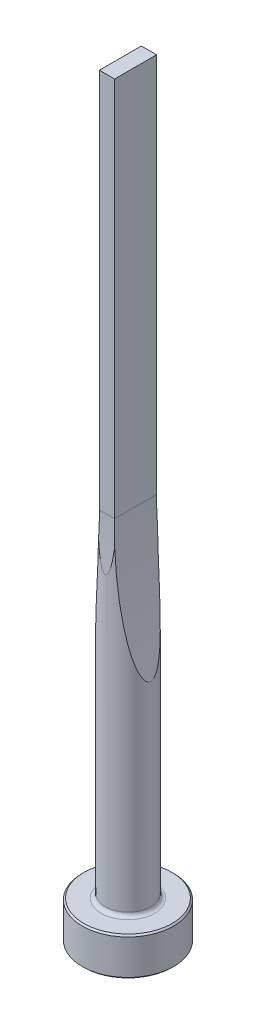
ISO-10303-21;
HEADER;
FILE_DESCRIPTION(('STEP AP214'),'2;1');
FILE_NAME('part.step','',(''),(''),'','','');
FILE_SCHEMA(('AUTOMOTIVE_DESIGN { 1 0 10303 214 1 1 1 1 }'));
ENDSEC;
DATA;
#1=APPLICATION_CONTEXT('core data for automotive mechanical design processes');
#2=APPLICATION_PROTOCOL_DEFINITION('international standard','automotive_design',2000,#1);
#3=PRODUCT_CONTEXT('',#1,'mechanical');
#4=PRODUCT('Part','Part','',(#3));
#5=PRODUCT_RELATED_PRODUCT_CATEGORY('part','',(#4));
#6=PRODUCT_DEFINITION_FORMATION('','',#4);
#7=PRODUCT_DEFINITION_CONTEXT('part definition',#1,'design');
#8=PRODUCT_DEFINITION('design','',#6,#7);
#9=PRODUCT_DEFINITION_SHAPE('','',#8);
#10=(LENGTH_UNIT() NAMED_UNIT(*) SI_UNIT(.MILLI.,.METRE.));
#11=(NAMED_UNIT(*) PLANE_ANGLE_UNIT() SI_UNIT($,.RADIAN.));
#12=(NAMED_UNIT(*) SI_UNIT($,.STERADIAN.) SOLID_ANGLE_UNIT());
#13=UNCERTAINTY_MEASURE_WITH_UNIT(LENGTH_MEASURE(1.E-05),#10,'distance_accuracy_value','');
#14=(GEOMETRIC_REPRESENTATION_CONTEXT(3) GLOBAL_UNCERTAINTY_ASSIGNED_CONTEXT((#13)) GLOBAL_UNIT_ASSIGNED_CONTEXT((#10,
#11,#12)) REPRESENTATION_CONTEXT('',''));
#15=CARTESIAN_POINT('',(0.,0.,0.));
#16=DIRECTION('',(0.,0.,1.));
#17=DIRECTION('',(1.,0.,0.));
#18=AXIS2_PLACEMENT_3D('',#15,#16,#17);
#19=CARTESIAN_POINT('',(0.,0.,0.));
#20=DIRECTION('',(0.,1.,0.));
#21=DIRECTION('',(-1.,0.,0.));
#22=AXIS2_PLACEMENT_3D('',#19,#20,#21);
#23=PLANE('',#22);
#24=CARTESIAN_POINT('',(0.,0.,0.));
#25=DIRECTION('',(0.,1.,0.));
#26=DIRECTION('',(-1.,0.,0.));
#27=AXIS2_PLACEMENT_3D('',#24,#25,#26);
#28=CIRCLE('',#27,5.8);
#29=CARTESIAN_POINT('',(-5.8,0.,0.));
#30=VERTEX_POINT('',#29);
#31=EDGE_CURVE('E133',#30,#30,#28,.T.);
#32=ORIENTED_EDGE('',*,*,#31,.F.);
#33=EDGE_LOOP('',(#32));
#34=FACE_BOUND('',#33,.T.);
#35=ADVANCED_FACE('F32',(#34),#23,.F.);
#36=CARTESIAN_POINT('',(0.,0.,0.));
#37=DIRECTION('',(0.,1.,0.));
#38=DIRECTION('',(-1.,0.,0.));
#39=AXIS2_PLACEMENT_3D('',#36,#37,#38);
#40=CONICAL_SURFACE('',#39,5.8,0.785398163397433);
#41=CARTESIAN_POINT('',(0.,0.200000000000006,0.));
#42=DIRECTION('',(0.,1.,0.));
#43=DIRECTION('',(-1.,0.,0.));
#44=AXIS2_PLACEMENT_3D('',#41,#42,#43);
#45=CIRCLE('',#44,6.);
#46=CARTESIAN_POINT('',(-6.,0.200000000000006,0.));
#47=VERTEX_POINT('',#46);
#48=EDGE_CURVE('E130',#47,#47,#45,.T.);
#49=ORIENTED_EDGE('',*,*,#48,.F.);
#50=EDGE_LOOP('',(#49));
#51=FACE_BOUND('',#50,.T.);
#52=ORIENTED_EDGE('',*,*,#31,.T.);
#53=EDGE_LOOP('',(#52));
#54=FACE_BOUND('',#53,.T.);
#55=ADVANCED_FACE('F171',(#51,#54),#40,.T.);
#56=CARTESIAN_POINT('',(0.,100.,0.));
#57=DIRECTION('',(0.,1.,0.));
#58=DIRECTION('',(-1.,0.,0.));
#59=AXIS2_PLACEMENT_3D('',#56,#57,#58);
#60=CYLINDRICAL_SURFACE('',#59,6.);
#61=CARTESIAN_POINT('',(0.,4.8,0.));
#62=DIRECTION('',(0.,1.,0.));
#63=DIRECTION('',(-1.,0.,0.));
#64=AXIS2_PLACEMENT_3D('',#61,#62,#63);
#65=CIRCLE('',#64,6.);
#66=CARTESIAN_POINT('',(-6.,4.8,0.));
#67=VERTEX_POINT('',#66);
#68=EDGE_CURVE('E127',#67,#67,#65,.T.);
#69=ORIENTED_EDGE('',*,*,#68,.F.);
#70=EDGE_LOOP('',(#69));
#71=FACE_BOUND('',#70,.T.);
#72=ORIENTED_EDGE('',*,*,#48,.T.);
#73=EDGE_LOOP('',(#72));
#74=FACE_BOUND('',#73,.T.);
#75=ADVANCED_FACE('F176',(#71,#74),#60,.T.);
#76=CARTESIAN_POINT('',(0.,4.8,0.));
#77=DIRECTION('',(0.,-1.,0.));
#78=DIRECTION('',(1.,0.,0.));
#79=AXIS2_PLACEMENT_3D('',#76,#77,#78);
#80=CONICAL_SURFACE('',#79,6.,0.785398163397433);
#81=CARTESIAN_POINT('',(0.,5.,0.));
#82=DIRECTION('',(0.,1.,0.));
#83=DIRECTION('',(-1.,0.,0.));
#84=AXIS2_PLACEMENT_3D('',#81,#82,#83);
#85=CIRCLE('',#84,5.8);
#86=CARTESIAN_POINT('',(-5.8,5.,0.));
#87=VERTEX_POINT('',#86);
#88=EDGE_CURVE('E124',#87,#87,#85,.T.);
#89=ORIENTED_EDGE('',*,*,#88,.F.);
#90=EDGE_LOOP('',(#89));
#91=FACE_BOUND('',#90,.T.);
#92=ORIENTED_EDGE('',*,*,#68,.T.);
#93=EDGE_LOOP('',(#92));
#94=FACE_BOUND('',#93,.T.);
#95=ADVANCED_FACE('F183',(#91,#94),#80,.T.);
#96=CARTESIAN_POINT('',(5.8,5.,0.));
#97=DIRECTION('',(0.,-1.,0.));
#98=DIRECTION('',(1.,0.,0.));
#99=AXIS2_PLACEMENT_3D('',#96,#97,#98);
#100=PLANE('',#99);
#101=CARTESIAN_POINT('',(0.,5.,0.));
#102=DIRECTION('',(0.,1.,0.));
#103=DIRECTION('',(-1.,0.,0.));
#104=AXIS2_PLACEMENT_3D('',#101,#102,#103);
#105=CIRCLE('',#104,3.50000000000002);
#106=CARTESIAN_POINT('',(-3.50000000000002,5.,0.));
#107=VERTEX_POINT('',#106);
#108=EDGE_CURVE('E121',#107,#107,#105,.T.);
#109=ORIENTED_EDGE('',*,*,#108,.F.);
#110=EDGE_LOOP('',(#109));
#111=FACE_BOUND('',#110,.T.);
#112=ORIENTED_EDGE('',*,*,#88,.T.);
#113=EDGE_LOOP('',(#112));
#114=FACE_BOUND('',#113,.T.);
#115=ADVANCED_FACE('F190',(#111,#114),#100,.F.);
#116=CARTESIAN_POINT('',(0.,5.5,0.));
#117=DIRECTION('',(0.,1.,0.));
#118=DIRECTION('',(-1.,0.,0.));
#119=AXIS2_PLACEMENT_3D('',#116,#117,#118);
#120=TOROIDAL_SURFACE('',#119,3.50000000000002,0.5);
#121=CARTESIAN_POINT('',(0.,5.50000000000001,0.));
#122=DIRECTION('',(0.,1.,0.));
#123=DIRECTION('',(-1.,0.,0.));
#124=AXIS2_PLACEMENT_3D('',#121,#122,#123);
#125=CIRCLE('',#124,3.00000000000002);
#126=CARTESIAN_POINT('',(-3.00000000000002,5.50000000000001,0.));
#127=VERTEX_POINT('',#126);
#128=EDGE_CURVE('E112',#127,#127,#125,.T.);
#129=ORIENTED_EDGE('',*,*,#128,.F.);
#130=EDGE_LOOP('',(#129));
#131=FACE_BOUND('',#130,.T.);
#132=ORIENTED_EDGE('',*,*,#108,.T.);
#133=EDGE_LOOP('',(#132));
#134=FACE_BOUND('',#133,.T.);
#135=ADVANCED_FACE('F168',(#131,#134),#120,.F.);
#136=CARTESIAN_POINT('',(0.,100.,0.));
#137=DIRECTION('',(0.,1.,0.));
#138=DIRECTION('',(-1.,0.,0.));
#139=AXIS2_PLACEMENT_3D('',#136,#137,#138);
#140=CYLINDRICAL_SURFACE('',#139,3.00000000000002);
#141=CARTESIAN_POINT('',(3.00000000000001,31.1320377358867,0.));
#142=CARTESIAN_POINT('',(3.00000022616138,31.1320366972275,0.0382289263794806));
#143=CARTESIAN_POINT('',(2.99926110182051,31.1354829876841,0.0764552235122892));
#144=CARTESIAN_POINT('',(2.99639888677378,31.1488399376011,0.151714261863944));
#145=CARTESIAN_POINT('',(2.99427413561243,31.1587583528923,0.188745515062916));
#146=CARTESIAN_POINT('',(2.98807781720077,31.187721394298,0.271228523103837));
#147=CARTESIAN_POINT('',(2.98362020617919,31.2085792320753,0.316004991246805));
#148=CARTESIAN_POINT('',(2.97331057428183,31.2569328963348,0.4016130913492));
#149=CARTESIAN_POINT('',(2.96745548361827,31.2844433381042,0.442435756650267));
#150=CARTESIAN_POINT('',(2.95008756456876,31.366275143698,0.549315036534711));
#151=CARTESIAN_POINT('',(2.93760642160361,31.4253156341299,0.611548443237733));
#152=CARTESIAN_POINT('',(2.91115377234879,31.5511686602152,0.727109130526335));
#153=CARTESIAN_POINT('',(2.89717771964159,31.6180049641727,0.780407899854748));
#154=CARTESIAN_POINT('',(2.86113354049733,31.7914444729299,0.905584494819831));
#155=CARTESIAN_POINT('',(2.83855915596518,31.901011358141,0.973158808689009));
#156=CARTESIAN_POINT('',(2.79269011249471,32.1258908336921,1.09783888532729));
#157=CARTESIAN_POINT('',(2.76939390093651,32.2412161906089,1.15491994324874));
#158=CARTESIAN_POINT('',(2.72247570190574,32.4759281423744,1.26155854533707));
#159=CARTESIAN_POINT('',(2.69885265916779,32.5953324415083,1.31107625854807));
#160=CARTESIAN_POINT('',(2.65169557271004,32.8363122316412,1.40399899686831));
#161=CARTESIAN_POINT('',(2.62816145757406,32.9578850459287,1.44741103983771));
#162=CARTESIAN_POINT('',(2.58116352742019,33.2034207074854,1.52965685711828));
#163=CARTESIAN_POINT('',(2.55770101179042,33.3273935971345,1.56846116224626));
#164=CARTESIAN_POINT('',(2.51108712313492,33.5765905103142,1.64205076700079));
#165=CARTESIAN_POINT('',(2.48793578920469,33.7018146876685,1.67683556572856));
#166=CARTESIAN_POINT('',(2.41902942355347,34.0790398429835,1.77618649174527));
#167=CARTESIAN_POINT('',(2.37384496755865,34.3324737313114,1.83571063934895));
#168=CARTESIAN_POINT('',(2.28521389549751,34.8423645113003,1.94492030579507));
#169=CARTESIAN_POINT('',(2.24177182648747,35.0988273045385,1.99458126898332));
#170=CARTESIAN_POINT('',(2.15691582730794,35.6133961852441,2.08604943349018));
#171=CARTESIAN_POINT('',(2.11550134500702,35.8715018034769,2.12785878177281));
#172=CARTESIAN_POINT('',(2.03467618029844,36.3897050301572,2.20527247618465));
#173=CARTESIAN_POINT('',(1.99527148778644,36.6498062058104,2.24085896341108));
#174=CARTESIAN_POINT('',(1.91865388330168,37.1710031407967,2.30679847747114));
#175=CARTESIAN_POINT('',(1.88144110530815,37.4320989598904,2.33715118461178));
#176=CARTESIAN_POINT('',(1.80931117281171,37.9546489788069,2.39342463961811));
#177=CARTESIAN_POINT('',(1.77439043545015,38.2161019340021,2.41935241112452));
#178=CARTESIAN_POINT('',(1.70680986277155,38.7396329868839,2.46749161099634));
#179=CARTESIAN_POINT('',(1.67414999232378,39.0017110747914,2.48970309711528));
#180=CARTESIAN_POINT('',(1.57940518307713,39.7902935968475,2.55171073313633));
#181=CARTESIAN_POINT('',(1.52076944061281,40.3175940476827,2.58671983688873));
#182=CARTESIAN_POINT('',(1.41278591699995,41.3737084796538,2.64723210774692));
#183=CARTESIAN_POINT('',(1.36343895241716,41.9025225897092,2.67273443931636));
#184=CARTESIAN_POINT('',(1.27407912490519,42.9614251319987,2.71646757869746));
#185=CARTESIAN_POINT('',(1.23406961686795,43.4915139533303,2.73469577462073));
#186=CARTESIAN_POINT('',(1.16344309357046,44.5524599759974,2.76547993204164));
#187=CARTESIAN_POINT('',(1.13282580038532,45.0833171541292,2.77803606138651));
#188=CARTESIAN_POINT('',(1.08091639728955,46.1473323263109,2.79864265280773));
#189=CARTESIAN_POINT('',(1.05965545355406,46.6804921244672,2.80667808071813));
#190=CARTESIAN_POINT('',(1.02661841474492,47.7471520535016,2.81892956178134));
#191=CARTESIAN_POINT('',(1.01484239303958,48.2806521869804,2.82314558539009));
#192=CARTESIAN_POINT('',(1.00078350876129,49.3476225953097,2.82815977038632));
#193=CARTESIAN_POINT('',(0.998497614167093,49.881092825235,2.82895902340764));
#194=CARTESIAN_POINT('',(1.00341174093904,50.9479814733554,2.82721980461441));
#195=CARTESIAN_POINT('',(1.01061171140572,51.4813998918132,2.8246813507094));
#196=CARTESIAN_POINT('',(1.0344746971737,52.5471327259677,2.81602973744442));
#197=CARTESIAN_POINT('',(1.05112237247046,53.0794475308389,2.80992237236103));
#198=CARTESIAN_POINT('',(1.09386114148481,54.1436435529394,2.79356276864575));
#199=CARTESIAN_POINT('',(1.11995236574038,54.6755247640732,2.78331047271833));
#200=CARTESIAN_POINT('',(1.18158570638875,55.7390218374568,2.75771131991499));
#201=CARTESIAN_POINT('',(1.21713492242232,56.2706371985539,2.74236063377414));
#202=CARTESIAN_POINT('',(1.29764729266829,57.3329136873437,2.7051957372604));
#203=CARTESIAN_POINT('',(1.34261005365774,57.8635748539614,2.68338179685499));
#204=CARTESIAN_POINT('',(1.4416710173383,58.9211233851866,2.63148216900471));
#205=CARTESIAN_POINT('',(1.4957252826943,59.4480167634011,2.6014358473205));
#206=CARTESIAN_POINT('',(1.61305086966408,60.500166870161,2.53037775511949));
#207=CARTESIAN_POINT('',(1.67632381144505,61.0254232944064,2.48936405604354));
#208=CARTESIAN_POINT('',(1.77798081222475,61.8110512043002,2.41671078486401));
#209=CARTESIAN_POINT('',(1.81296647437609,62.0723841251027,2.39065784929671));
#210=CARTESIAN_POINT('',(1.88516434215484,62.5942622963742,2.33415203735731));
#211=CARTESIAN_POINT('',(1.92237646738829,62.8548075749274,2.30369931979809));
#212=CARTESIAN_POINT('',(1.99897145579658,63.3748259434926,2.23755936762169));
#213=CARTESIAN_POINT('',(2.03835358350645,63.6342993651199,2.20187389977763));
#214=CARTESIAN_POINT('',(2.11923244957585,64.1519525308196,2.12414949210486));
#215=CARTESIAN_POINT('',(2.16072897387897,64.4101324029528,2.08211119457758));
#216=CARTESIAN_POINT('',(2.22438951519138,64.7955347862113,2.01322026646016));
#217=CARTESIAN_POINT('',(2.24579780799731,64.9234162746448,1.98934230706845));
#218=CARTESIAN_POINT('',(2.28909512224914,65.178672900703,1.93936563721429));
#219=CARTESIAN_POINT('',(2.31098417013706,65.3060480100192,1.91326680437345));
#220=CARTESIAN_POINT('',(2.35524194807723,65.5603194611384,1.85851444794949));
#221=CARTESIAN_POINT('',(2.37761118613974,65.6872151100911,1.82985810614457));
#222=CARTESIAN_POINT('',(2.42277149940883,65.9402353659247,1.76963159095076));
#223=CARTESIAN_POINT('',(2.44556255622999,66.0663600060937,1.73806154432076));
#224=CARTESIAN_POINT('',(2.49132183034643,66.3165535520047,1.67180247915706));
#225=CARTESIAN_POINT('',(2.51428679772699,66.4406308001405,1.63714288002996));
#226=CARTESIAN_POINT('',(2.56052018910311,66.6875456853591,1.5638466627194));
#227=CARTESIAN_POINT('',(2.58378858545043,66.8103834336,1.52521040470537));
#228=CARTESIAN_POINT('',(2.63049823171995,67.0542236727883,1.44315833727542));
#229=CARTESIAN_POINT('',(2.65393918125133,67.1752285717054,1.39974955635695));
#230=CARTESIAN_POINT('',(2.7008675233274,67.414881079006,1.3069172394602));
#231=CARTESIAN_POINT('',(2.72435488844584,67.5335297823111,1.25749657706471));
#232=CARTESIAN_POINT('',(2.75720311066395,67.6977721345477,1.18253203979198));
#233=CARTESIAN_POINT('',(2.76665795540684,67.7448478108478,1.16026794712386));
#234=CARTESIAN_POINT('',(2.78550256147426,67.8382934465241,1.11426796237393));
#235=CARTESIAN_POINT('',(2.79489231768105,67.8846633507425,1.09053195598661));
#236=CARTESIAN_POINT('',(2.82298244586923,68.0228304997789,1.01664624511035));
#237=CARTESIAN_POINT('',(2.84153288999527,68.1133315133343,0.963976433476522));
#238=CARTESIAN_POINT('',(2.87800082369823,68.2899266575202,0.849014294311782));
#239=CARTESIAN_POINT('',(2.89590869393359,68.3759588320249,0.786619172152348));
#240=CARTESIAN_POINT('',(2.92128092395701,68.4970528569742,0.68362277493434));
#241=CARTESIAN_POINT('',(2.92947327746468,68.53601293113,0.647814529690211));
#242=CARTESIAN_POINT('',(2.94512917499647,68.610243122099,0.572450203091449));
#243=CARTESIAN_POINT('',(2.95259387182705,68.6455190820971,0.532900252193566));
#244=CARTESIAN_POINT('',(2.96507601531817,68.7043545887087,0.457682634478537));
#245=CARTESIAN_POINT('',(2.97028566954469,68.7288523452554,0.422789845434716));
#246=CARTESIAN_POINT('',(2.97973939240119,68.7732319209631,0.349998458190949));
#247=CARTESIAN_POINT('',(2.98398345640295,68.7931137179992,0.31209984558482));
#248=CARTESIAN_POINT('',(2.99120737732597,68.826914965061,0.232964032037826));
#249=CARTESIAN_POINT('',(2.99417050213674,68.840755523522,0.191690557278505));
#250=CARTESIAN_POINT('',(2.99838013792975,68.860408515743,0.1072021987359));
#251=CARTESIAN_POINT('',(2.99963012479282,68.8662372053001,0.0639914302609));
#252=CARTESIAN_POINT('',(3.00019630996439,68.8688778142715,-0.0181336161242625));
#253=CARTESIAN_POINT('',(2.99970295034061,68.8665777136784,-0.0570192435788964));
#254=CARTESIAN_POINT('',(2.99726373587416,68.8551966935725,-0.133743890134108));
#255=CARTESIAN_POINT('',(2.99531641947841,68.8461089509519,-0.171581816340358));
#256=CARTESIAN_POINT('',(2.98959413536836,68.8193698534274,-0.25376472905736));
#257=CARTESIAN_POINT('',(2.98550081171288,68.8002248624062,-0.297592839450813));
#258=CARTESIAN_POINT('',(2.97593628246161,68.7553921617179,-0.381574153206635));
#259=CARTESIAN_POINT('',(2.97046224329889,68.7296909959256,-0.421719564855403));
#260=CARTESIAN_POINT('',(2.95432862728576,68.6537426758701,-0.525716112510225));
#261=CARTESIAN_POINT('',(2.9427497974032,68.5990377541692,-0.586122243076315));
#262=CARTESIAN_POINT('',(2.91810481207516,68.4819743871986,-0.698550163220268));
#263=CARTESIAN_POINT('',(2.90503417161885,68.4195928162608,-0.75054547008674));
#264=CARTESIAN_POINT('',(2.87174720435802,68.2598039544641,-0.870990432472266));
#265=CARTESIAN_POINT('',(2.85105828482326,68.1597081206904,-0.935696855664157));
#266=CARTESIAN_POINT('',(2.80892115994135,67.9539617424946,-1.05544164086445));
#267=CARTESIAN_POINT('',(2.78747133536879,67.8482990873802,-1.11045768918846));
#268=CARTESIAN_POINT('',(2.74418685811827,67.6330247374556,-1.21349533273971));
#269=CARTESIAN_POINT('',(2.72235077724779,67.5233952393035,-1.26147873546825));
#270=CARTESIAN_POINT('',(2.67868820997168,67.3019829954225,-1.3517143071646));
#271=CARTESIAN_POINT('',(2.65686174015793,67.1902027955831,-1.39397282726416));
#272=CARTESIAN_POINT('',(2.61377608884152,66.9672642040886,-1.47314729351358));
#273=CARTESIAN_POINT('',(2.59251428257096,66.8561379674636,-1.51015307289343));
#274=CARTESIAN_POINT('',(2.55020507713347,66.6327002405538,-1.58054872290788));
#275=CARTESIAN_POINT('',(2.5291577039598,66.5203886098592,-1.6139381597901));
#276=CARTESIAN_POINT('',(2.46641237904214,66.1819801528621,-1.70957968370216));
#277=CARTESIAN_POINT('',(2.42513167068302,65.954515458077,-1.76726883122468));
#278=CARTESIAN_POINT('',(2.34389066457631,65.4967254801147,-1.8736686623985));
#279=CARTESIAN_POINT('',(2.30393376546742,65.266394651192,-1.92235751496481));
#280=CARTESIAN_POINT('',(2.22560869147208,64.8041341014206,-2.01251797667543));
#281=CARTESIAN_POINT('',(2.18724009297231,64.572204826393,-2.05399151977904));
#282=CARTESIAN_POINT('',(2.11209208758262,64.1065792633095,-2.13118981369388));
#283=CARTESIAN_POINT('',(2.07531657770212,63.8728801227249,-2.16690099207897));
#284=CARTESIAN_POINT('',(2.00351057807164,63.4045144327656,-2.23345911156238));
#285=CARTESIAN_POINT('',(1.96848019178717,63.1698478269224,-2.26430576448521));
#286=CARTESIAN_POINT('',(1.90025903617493,62.7000948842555,-2.32185349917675));
#287=CARTESIAN_POINT('',(1.86706568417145,62.4650096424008,-2.34856050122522));
#288=CARTESIAN_POINT('',(1.80249449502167,61.9942265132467,-2.39847310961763));
#289=CARTESIAN_POINT('',(1.77111663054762,61.7585286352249,-2.42167876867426));
#290=CARTESIAN_POINT('',(1.67974647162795,61.050729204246,-2.4867807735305));
#291=CARTESIAN_POINT('',(1.62250766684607,60.5778534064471,-2.52417022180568));
#292=CARTESIAN_POINT('',(1.51548416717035,59.6306110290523,-2.58983087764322));
#293=CARTESIAN_POINT('',(1.46570013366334,59.1562443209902,-2.61810127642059));
#294=CARTESIAN_POINT('',(1.37363740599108,58.206273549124,-2.66755500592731));
#295=CARTESIAN_POINT('',(1.33136100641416,57.7306691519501,-2.68873617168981));
#296=CARTESIAN_POINT('',(1.25436923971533,56.7786316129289,-2.72550422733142));
#297=CARTESIAN_POINT('',(1.21965398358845,56.3021984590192,-2.74109103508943));
#298=CARTESIAN_POINT('',(1.15774683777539,55.3477742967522,-2.7678077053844));
#299=CARTESIAN_POINT('',(1.1305699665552,54.8697820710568,-2.77892869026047));
#300=CARTESIAN_POINT('',(1.0838450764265,53.9133518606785,-2.79748288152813));
#301=CARTESIAN_POINT('',(1.06429711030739,53.4349138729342,-2.80491606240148));
#302=CARTESIAN_POINT('',(1.03284197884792,52.4778381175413,-2.81665023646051));
#303=CARTESIAN_POINT('',(1.0209333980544,51.9992004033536,-2.82095180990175));
#304=CARTESIAN_POINT('',(1.00475611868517,51.041780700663,-2.82675409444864));
#305=CARTESIAN_POINT('',(1.00048739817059,50.5629987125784,-2.82825481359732));
#306=CARTESIAN_POINT('',(0.999592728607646,49.6068472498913,-2.82857110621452));
#307=CARTESIAN_POINT('',(1.00294414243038,49.12947779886,-2.82739463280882));
#308=CARTESIAN_POINT('',(1.01724188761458,48.1748658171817,-2.82228220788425));
#309=CARTESIAN_POINT('',(1.02818823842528,47.6976232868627,-2.81834624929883));
#310=CARTESIAN_POINT('',(1.05767415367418,46.7433220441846,-2.80741397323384));
#311=CARTESIAN_POINT('',(1.07621506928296,46.2662633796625,-2.80041711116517));
#312=CARTESIAN_POINT('',(1.12088191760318,45.3125687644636,-2.78284043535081));
#313=CARTESIAN_POINT('',(1.14700780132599,44.8359328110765,-2.77226064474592));
#314=CARTESIAN_POINT('',(1.20678398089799,43.8840018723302,-2.74676682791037));
#315=CARTESIAN_POINT('',(1.24042234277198,43.4087059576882,-2.73185966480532));
#316=CARTESIAN_POINT('',(1.31522508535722,42.4589081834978,-2.69664530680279));
#317=CARTESIAN_POINT('',(1.35638936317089,41.9844063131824,-2.67633818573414));
#318=CARTESIAN_POINT('',(1.44619587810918,41.0365906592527,-2.62889658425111));
#319=CARTESIAN_POINT('',(1.49483588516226,40.5632765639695,-2.60176413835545));
#320=CARTESIAN_POINT('',(1.59954373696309,39.6180706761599,-2.53874310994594));
#321=CARTESIAN_POINT('',(1.65561095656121,39.146178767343,-2.50285526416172));
#322=CARTESIAN_POINT('',(1.74253420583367,38.4608699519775,-2.44226518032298));
#323=CARTESIAN_POINT('',(1.77048698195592,38.2466764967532,-2.4221185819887));
#324=CARTESIAN_POINT('',(1.82789751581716,37.8187546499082,-2.37909262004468));
#325=CARTESIAN_POINT('',(1.85735533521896,37.6050262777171,-2.35621314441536));
#326=CARTESIAN_POINT('',(1.91774137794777,37.1782362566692,-2.30733108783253));
#327=CARTESIAN_POINT('',(1.9486689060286,36.9651743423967,-2.2813299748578));
#328=CARTESIAN_POINT('',(2.01197930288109,36.5397466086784,-2.22569407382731));
#329=CARTESIAN_POINT('',(2.04436213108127,36.327380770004,-2.1960593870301));
#330=CARTESIAN_POINT('',(2.12282503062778,35.8248724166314,-2.12075062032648));
#331=CARTESIAN_POINT('',(2.16952978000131,35.5351034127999,-2.07320475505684));
#332=CARTESIAN_POINT('',(2.2654773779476,34.9577225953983,-1.96792275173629));
#333=CARTESIAN_POINT('',(2.31472085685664,34.6701113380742,-1.91018407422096));
#334=CARTESIAN_POINT('',(2.39992455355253,34.186493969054,-1.80098498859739));
#335=CARTESIAN_POINT('',(2.43529880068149,33.9895864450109,-1.75307812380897));
#336=CARTESIAN_POINT('',(2.5069386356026,33.5982442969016,-1.6490225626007));
#337=CARTESIAN_POINT('',(2.54320352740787,33.4038079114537,-1.59288014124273));
#338=CARTESIAN_POINT('',(2.6053446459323,33.0765342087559,-1.48817918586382));
#339=CARTESIAN_POINT('',(2.63106114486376,32.942776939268,-1.44242693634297));
#340=CARTESIAN_POINT('',(2.68266526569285,32.6775673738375,-1.34402450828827));
#341=CARTESIAN_POINT('',(2.70855310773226,32.5461195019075,-1.29136244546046));
#342=CARTESIAN_POINT('',(2.76181569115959,32.2787562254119,-1.1734069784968));
#343=CARTESIAN_POINT('',(2.78918019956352,32.1430889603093,-1.10752295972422));
#344=CARTESIAN_POINT('',(2.82944954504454,31.9456774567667,-0.997847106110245));
#345=CARTESIAN_POINT('',(2.84272536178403,31.8809733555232,-0.959540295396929));
#346=CARTESIAN_POINT('',(2.86883651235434,31.7543929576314,-0.878409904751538));
#347=CARTESIAN_POINT('',(2.88167220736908,31.6925143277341,-0.835590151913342));
#348=CARTESIAN_POINT('',(2.90412303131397,31.5848198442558,-0.753328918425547));
#349=CARTESIAN_POINT('',(2.91387080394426,31.5382576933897,-0.714910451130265));
#350=CARTESIAN_POINT('',(2.93264854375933,31.4488897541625,-0.633500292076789));
#351=CARTESIAN_POINT('',(2.94167693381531,31.4060921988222,-0.590499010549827));
#352=CARTESIAN_POINT('',(2.95868478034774,31.3257257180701,-0.4984143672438));
#353=CARTESIAN_POINT('',(2.96664701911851,31.2882421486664,-0.449251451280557));
#354=CARTESIAN_POINT('',(2.98058913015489,31.2227682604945,-0.344714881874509));
#355=CARTESIAN_POINT('',(2.98657844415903,31.1947327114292,-0.289372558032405));
#356=CARTESIAN_POINT('',(2.9939284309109,31.1603726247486,-0.194344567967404));
#357=CARTESIAN_POINT('',(2.99617998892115,31.1498617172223,-0.156258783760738));
#358=CARTESIAN_POINT('',(2.99921465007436,31.1356995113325,-0.0787798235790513));
#359=CARTESIAN_POINT('',(2.99999976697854,31.1320388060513,-0.0393885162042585));
#360=CARTESIAN_POINT('',(3.00000000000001,31.1320377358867,0.));
#361=B_SPLINE_CURVE_WITH_KNOTS('',3,(#141,#142,#143,#144,#145,#146,#147,#148,#149,#150,#151,
#152,#153,#154,#155,#156,#157,#158,#159,#160,#161,#162,#163,#164,#165,#166,#167,#168,#169,#170,
#171,#172,#173,#174,#175,#176,#177,#178,#179,#180,#181,#182,#183,#184,#185,#186,#187,#188,#189,
#190,#191,#192,#193,#194,#195,#196,#197,#198,#199,#200,#201,#202,#203,#204,#205,#206,#207,#208,
#209,#210,#211,#212,#213,#214,#215,#216,#217,#218,#219,#220,#221,#222,#223,#224,#225,#226,#227,
#228,#229,#230,#231,#232,#233,#234,#235,#236,#237,#238,#239,#240,#241,#242,#243,#244,#245,#246,
#247,#248,#249,#250,#251,#252,#253,#254,#255,#256,#257,#258,#259,#260,#261,#262,#263,#264,#265,
#266,#267,#268,#269,#270,#271,#272,#273,#274,#275,#276,#277,#278,#279,#280,#281,#282,#283,#284,
#285,#286,#287,#288,#289,#290,#291,#292,#293,#294,#295,#296,#297,#298,#299,#300,#301,#302,#303,
#304,#305,#306,#307,#308,#309,#310,#311,#312,#313,#314,#315,#316,#317,#318,#319,#320,#321,#322,
#323,#324,#325,#326,#327,#328,#329,#330,#331,#332,#333,#334,#335,#336,#337,#338,#339,#340,#341,
#342,#343,#344,#345,#346,#347,#348,#349,#350,#351,#352,#353,#354,#355,#356,#357,#358,#359,#360),
.UNSPECIFIED.,.T.,.F.,(4,2,2,2,2,2,2,2,2,2,2,2,2,2,2,2,2,2,2,2,2,2,2,2,2,2,2,2,2,2,2,2,2,2,2,2,
2,2,2,2,2,2,2,2,2,2,2,2,2,2,2,2,2,2,2,2,2,2,2,2,2,2,2,2,2,2,2,2,2,2,2,2,2,2,2,2,2,2,2,2,2,2,2,2,
2,2,2,2,2,2,2,2,2,2,2,2,2,2,2,2,2,2,2,2,2,2,2,2,2,4),(0.,0.114530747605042,0.229198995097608,
0.377146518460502,0.525422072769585,0.784016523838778,1.04342108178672,1.43450960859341,
1.82650742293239,2.2205032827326,2.61404251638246,3.0099766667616,3.40596010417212,
4.19830991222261,4.99260830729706,5.78668919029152,6.58301287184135,7.3793851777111,
8.17448141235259,8.96956528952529,10.564456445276,12.1594877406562,13.7550912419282,
15.3506475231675,16.9514791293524,18.5523231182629,20.152655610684,21.7529795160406,
23.350712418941,24.948467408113,26.5474251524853,28.1463161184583,29.7376910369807,
31.3293459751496,32.1241543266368,32.9189339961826,33.7134459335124,34.5078775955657,
34.9033853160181,35.2989148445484,35.6948857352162,36.0908394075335,36.4833596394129,
36.8758443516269,37.2677586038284,37.6594862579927,37.8182445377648,37.9770151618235,
38.295734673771,38.6180854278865,38.7785394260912,38.9387349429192,39.0673064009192,
39.1958784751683,39.3260826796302,39.4560223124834,39.5722268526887,39.6885483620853,
39.8317500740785,39.9752480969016,40.2207965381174,40.4671036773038,40.8291068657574,
41.1919330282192,41.5566618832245,41.9209827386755,42.2780286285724,42.6351172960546,
43.3496348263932,44.0658633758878,44.7818996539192,45.4995985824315,46.2173400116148,
46.9340453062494,47.6507398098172,49.0839199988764,50.517227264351,51.9509718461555,
53.384737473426,54.8213393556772,56.2579511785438,57.6942967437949,59.130638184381,
60.5627182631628,61.9948020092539,63.4271406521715,64.8594700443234,66.2895400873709,
67.7195905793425,69.1492153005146,70.5787197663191,71.2295431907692,71.8803933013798,
72.5309385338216,73.1814656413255,74.0733253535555,74.9654075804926,75.582426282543,
76.1989772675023,76.6298882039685,77.0615502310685,77.5206861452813,77.749625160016,
77.9783715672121,78.1616043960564,78.3452284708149,78.5315304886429,78.716927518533,
78.8350946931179,78.9530994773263),.UNSPECIFIED.);
#362=CARTESIAN_POINT('',(1.05745310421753,46.7846838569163,-2.80745310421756));
#363=VERTEX_POINT('',#362);
#364=CARTESIAN_POINT('',(1.05745310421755,46.7846838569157,2.80745310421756));
#365=VERTEX_POINT('',#364);
#366=EDGE_CURVE('E138',#363,#365,#361,.T.);
#367=ORIENTED_EDGE('',*,*,#366,.T.);
#368=CARTESIAN_POINT('',(-1.19895788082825,50.,2.74999999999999));
#369=CARTESIAN_POINT('',(-1.19897952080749,50.5078240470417,2.75000052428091));
#370=CARTESIAN_POINT('',(-1.18927252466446,51.0156821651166,2.75430147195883));
#371=CARTESIAN_POINT('',(-1.15875125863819,51.7777588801,2.76719867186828));
#372=CARTESIAN_POINT('',(-1.14587302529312,52.0323726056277,2.77259034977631));
#373=CARTESIAN_POINT('',(-1.11408427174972,52.541075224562,2.7855202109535));
#374=CARTESIAN_POINT('',(-1.09517627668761,52.7951642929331,2.79305749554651));
#375=CARTESIAN_POINT('',(-1.05054489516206,53.2992875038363,2.81014523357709));
#376=CARTESIAN_POINT('',(-1.02491501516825,53.5493308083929,2.81966772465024));
#377=CARTESIAN_POINT('',(-0.96493247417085,54.0487156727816,2.840765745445));
#378=CARTESIAN_POINT('',(-0.930566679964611,54.298055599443,2.8523443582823));
#379=CARTESIAN_POINT('',(-0.870049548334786,54.6696537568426,2.87113933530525));
#380=CARTESIAN_POINT('',(-0.848472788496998,54.7926943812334,2.87761721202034));
#381=CARTESIAN_POINT('',(-0.801568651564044,55.038027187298,2.89103629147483));
#382=CARTESIAN_POINT('',(-0.776241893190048,55.1603194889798,2.89797741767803));
#383=CARTESIAN_POINT('',(-0.720753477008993,55.4034742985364,2.9122725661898));
#384=CARTESIAN_POINT('',(-0.69060352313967,55.5243395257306,2.91962556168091));
#385=CARTESIAN_POINT('',(-0.623527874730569,55.7641294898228,2.93469409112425));
#386=CARTESIAN_POINT('',(-0.586609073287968,55.8830560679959,2.94240925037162));
#387=CARTESIAN_POINT('',(-0.532225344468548,56.0331253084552,2.95243594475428));
#388=CARTESIAN_POINT('',(-0.519782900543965,56.0660915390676,2.9546570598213));
#389=CARTESIAN_POINT('',(-0.493824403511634,56.1316010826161,2.95910656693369));
#390=CARTESIAN_POINT('',(-0.480308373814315,56.1641444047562,2.96133495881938));
#391=CARTESIAN_POINT('',(-0.437923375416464,56.2607815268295,2.96800415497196));
#392=CARTESIAN_POINT('',(-0.40716074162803,56.3240456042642,2.97243989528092));
#393=CARTESIAN_POINT('',(-0.339480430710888,56.4432950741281,2.98092262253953));
#394=CARTESIAN_POINT('',(-0.302974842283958,56.4994884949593,2.98497775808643));
#395=CARTESIAN_POINT('',(-0.243249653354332,56.5706099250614,2.99016761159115));
#396=CARTESIAN_POINT('',(-0.22538065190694,56.5899122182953,2.99158318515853));
#397=CARTESIAN_POINT('',(-0.187063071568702,56.6257850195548,2.99422420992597));
#398=CARTESIAN_POINT('',(-0.166623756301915,56.6423648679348,2.9954503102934));
#399=CARTESIAN_POINT('',(-0.132225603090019,56.6647469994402,2.9971102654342));
#400=CARTESIAN_POINT('',(-0.11929686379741,56.6721061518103,2.99765718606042));
#401=CARTESIAN_POINT('',(-0.0924786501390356,56.6848335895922,2.99860424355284));
#402=CARTESIAN_POINT('',(-0.0785901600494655,56.6902038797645,2.99900452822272));
#403=CARTESIAN_POINT('',(-0.0498799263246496,56.6984547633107,2.99961993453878));
#404=CARTESIAN_POINT('',(-0.0350488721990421,56.7013042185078,2.99983274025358));
#405=CARTESIAN_POINT('',(-0.00511706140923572,56.7039833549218,3.00003281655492));
#406=CARTESIAN_POINT('',(0.00998340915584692,56.7038160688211,3.00002031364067));
#407=CARTESIAN_POINT('',(0.0377473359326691,56.7007339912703,2.99979016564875));
#408=CARTESIAN_POINT('',(0.0504568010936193,56.698205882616,2.99960139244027));
#409=CARTESIAN_POINT('',(0.075326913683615,56.691216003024,2.99908000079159));
#410=CARTESIAN_POINT('',(0.0874870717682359,56.6867525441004,2.99874725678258));
#411=CARTESIAN_POINT('',(0.117304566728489,56.6734908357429,2.99776000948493));
#412=CARTESIAN_POINT('',(0.134490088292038,56.6636473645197,2.99702831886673));
#413=CARTESIAN_POINT('',(0.16715399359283,56.6414692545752,2.99538445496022));
#414=CARTESIAN_POINT('',(0.182627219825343,56.6291273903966,2.99447175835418));
#415=CARTESIAN_POINT('',(0.225718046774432,56.5906116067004,2.99163284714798));
#416=CARTESIAN_POINT('',(0.251307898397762,56.5622150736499,2.98955095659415));
#417=CARTESIAN_POINT('',(0.298583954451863,56.5023955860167,2.98519748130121));
#418=CARTESIAN_POINT('',(0.320256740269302,56.4709627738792,2.98292528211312));
#419=CARTESIAN_POINT('',(0.376076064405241,56.3821026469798,2.97655204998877));
#420=CARTESIAN_POINT('',(0.407351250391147,56.3228981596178,2.97236032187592));
#421=CARTESIAN_POINT('',(0.464715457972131,56.2019914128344,2.96392635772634));
#422=CARTESIAN_POINT('',(0.490790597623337,56.14028298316,2.95968401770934));
#423=CARTESIAN_POINT('',(0.539393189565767,56.0151533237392,2.95121450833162));
#424=CARTESIAN_POINT('',(0.561903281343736,55.9517253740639,2.94698750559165));
#425=CARTESIAN_POINT('',(0.604138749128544,55.8240591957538,2.93861747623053));
#426=CARTESIAN_POINT('',(0.623867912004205,55.7598222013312,2.93447434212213));
#427=CARTESIAN_POINT('',(0.687009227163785,55.5416029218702,2.92063784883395));
#428=CARTESIAN_POINT('',(0.725502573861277,55.3861879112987,2.91118093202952));
#429=CARTESIAN_POINT('',(0.794909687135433,55.0736090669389,2.892985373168));
#430=CARTESIAN_POINT('',(0.825818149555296,54.9164440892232,2.88424723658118));
#431=CARTESIAN_POINT('',(0.882130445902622,54.6006711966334,2.86752741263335));
#432=CARTESIAN_POINT('',(0.907519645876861,54.4420605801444,2.85954776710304));
#433=CARTESIAN_POINT('',(0.953912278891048,54.1242228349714,2.84440447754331));
#434=CARTESIAN_POINT('',(0.974917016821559,53.9649959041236,2.83724059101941));
#435=CARTESIAN_POINT('',(1.03276252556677,53.4851511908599,2.8169332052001));
#436=CARTESIAN_POINT('',(1.06419241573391,53.1638255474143,2.80505126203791));
#437=CARTESIAN_POINT('',(1.11623470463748,52.5208794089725,2.78473743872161));
#438=CARTESIAN_POINT('',(1.1368683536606,52.1992607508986,2.77629878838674));
#439=CARTESIAN_POINT('',(1.16917424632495,51.5546671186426,2.76284984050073));
#440=CARTESIAN_POINT('',(1.18082300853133,51.231690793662,2.75784852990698));
#441=CARTESIAN_POINT('',(1.19594203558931,50.5855107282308,2.7513245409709));
#442=CARTESIAN_POINT('',(1.19941212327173,50.2623069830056,2.74980193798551));
#443=CARTESIAN_POINT('',(1.19840705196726,49.6145622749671,2.75024017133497));
#444=CARTESIAN_POINT('',(1.19389860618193,49.290021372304,2.75221560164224));
#445=CARTESIAN_POINT('',(1.17656472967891,48.641319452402,2.75967187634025));
#446=CARTESIAN_POINT('',(1.16374248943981,48.3171583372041,2.76515137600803));
#447=CARTESIAN_POINT('',(1.12903192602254,47.673678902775,2.77950240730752));
#448=CARTESIAN_POINT('',(1.10726533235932,47.3543530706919,2.78832827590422));
#449=CARTESIAN_POINT('',(1.05280621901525,46.7162712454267,2.80935794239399));
#450=CARTESIAN_POINT('',(1.02009944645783,46.3975165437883,2.8215661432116));
#451=CARTESIAN_POINT('',(0.960080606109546,45.9219501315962,2.84230016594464));
#452=CARTESIAN_POINT('',(0.938338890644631,45.7643795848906,2.84958669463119));
#453=CARTESIAN_POINT('',(0.890325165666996,45.4498925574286,2.86495508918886));
#454=CARTESIAN_POINT('',(0.864051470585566,45.2929763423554,2.87303725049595));
#455=CARTESIAN_POINT('',(0.805707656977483,44.9806378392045,2.88993979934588));
#456=CARTESIAN_POINT('',(0.77365112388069,44.8252129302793,2.89875843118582));
#457=CARTESIAN_POINT('',(0.701473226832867,44.5163138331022,2.917082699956));
#458=CARTESIAN_POINT('',(0.661358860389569,44.3628380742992,2.9265877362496));
#459=CARTESIAN_POINT('',(0.599571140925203,44.1622791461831,2.93951368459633));
#460=CARTESIAN_POINT('',(0.583753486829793,44.1133825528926,2.94270568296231));
#461=CARTESIAN_POINT('',(0.550376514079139,44.016151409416,2.94913181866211));
#462=CARTESIAN_POINT('',(0.532816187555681,43.9678172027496,2.95236597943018));
#463=CARTESIAN_POINT('',(0.495474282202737,43.871876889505,2.95886221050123));
#464=CARTESIAN_POINT('',(0.47568748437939,43.8242728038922,2.96212432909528));
#465=CARTESIAN_POINT('',(0.433230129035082,43.7303798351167,2.96863184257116));
#466=CARTESIAN_POINT('',(0.410562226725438,43.6840897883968,2.97187725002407));
#467=CARTESIAN_POINT('',(0.360948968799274,43.5932525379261,2.97831355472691));
#468=CARTESIAN_POINT('',(0.333963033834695,43.548727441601,2.9815035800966));
#469=CARTESIAN_POINT('',(0.273823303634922,43.4640019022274,2.98763333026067));
#470=CARTESIAN_POINT('',(0.240714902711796,43.4237728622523,2.99057467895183));
#471=CARTESIAN_POINT('',(0.187908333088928,43.3753088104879,2.99414413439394));
#472=CARTESIAN_POINT('',(0.172443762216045,43.3625865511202,2.99508437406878));
#473=CARTESIAN_POINT('',(0.139769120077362,43.3396025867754,2.99678704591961));
#474=CARTESIAN_POINT('',(0.122564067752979,43.3293340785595,2.99754996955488));
#475=CARTESIAN_POINT('',(0.0920979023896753,43.3150686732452,2.99861155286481));
#476=CARTESIAN_POINT('',(0.079292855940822,43.3101148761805,2.99898077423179));
#477=CARTESIAN_POINT('',(0.0530412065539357,43.3023526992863,2.9995596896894));
#478=CARTESIAN_POINT('',(0.0395953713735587,43.2995418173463,2.99976956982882));
#479=CARTESIAN_POINT('',(0.012323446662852,43.2963783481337,3.00000579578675));
#480=CARTESIAN_POINT('',(-0.00150445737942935,43.2960408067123,3.00003101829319));
#481=CARTESIAN_POINT('',(-0.0289863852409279,43.2979088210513,2.99989150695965));
#482=CARTESIAN_POINT('',(-0.0426403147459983,43.3001157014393,2.99972667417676));
#483=CARTESIAN_POINT('',(-0.0713132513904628,43.3072893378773,2.9991914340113));
#484=CARTESIAN_POINT('',(-0.086240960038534,43.3126116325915,2.998794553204));
#485=CARTESIAN_POINT('',(-0.115034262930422,43.3255893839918,2.99782852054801));
#486=CARTESIAN_POINT('',(-0.128897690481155,43.3332494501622,2.99725902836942));
#487=CARTESIAN_POINT('',(-0.163968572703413,43.355677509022,2.99559526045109));
#488=CARTESIAN_POINT('',(-0.184247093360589,43.3718697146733,2.99439742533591));
#489=CARTESIAN_POINT('',(-0.222285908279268,43.4069419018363,2.99181430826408));
#490=CARTESIAN_POINT('',(-0.240038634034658,43.425829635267,2.99042848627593));
#491=CARTESIAN_POINT('',(-0.280818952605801,43.4738008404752,2.98692562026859));
#492=CARTESIAN_POINT('',(-0.302801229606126,43.5037572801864,2.98475182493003));
#493=CARTESIAN_POINT('',(-0.343876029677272,43.5656071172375,2.9802970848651));
#494=CARTESIAN_POINT('',(-0.362961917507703,43.5975047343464,2.9780159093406));
#495=CARTESIAN_POINT('',(-0.417189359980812,43.6952833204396,2.97107815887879));
#496=CARTESIAN_POINT('',(-0.449076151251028,43.7629467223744,2.96634960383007));
#497=CARTESIAN_POINT('',(-0.507522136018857,43.9004515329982,2.95690285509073));
#498=CARTESIAN_POINT('',(-0.534078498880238,43.9702940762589,2.95218466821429));
#499=CARTESIAN_POINT('',(-0.583437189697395,44.1113147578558,2.94282667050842));
#500=CARTESIAN_POINT('',(-0.606238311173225,44.1824933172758,2.93818688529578));
#501=CARTESIAN_POINT('',(-0.670588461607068,44.397607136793,2.92442540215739));
#502=CARTESIAN_POINT('',(-0.707956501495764,44.5427891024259,2.91548441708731));
#503=CARTESIAN_POINT('',(-0.775545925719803,44.8347309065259,2.89822529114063));
#504=CARTESIAN_POINT('',(-0.805769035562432,44.9814903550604,2.8899070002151));
#505=CARTESIAN_POINT('',(-0.860937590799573,45.275810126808,2.87395360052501));
#506=CARTESIAN_POINT('',(-0.885890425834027,45.4233690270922,2.86631754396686));
#507=CARTESIAN_POINT('',(-0.937056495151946,45.753486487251,2.85005332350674));
#508=CARTESIAN_POINT('',(-0.962216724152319,45.9362151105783,2.84160657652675));
#509=CARTESIAN_POINT('',(-1.00766798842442,46.3023321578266,2.82580502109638));
#510=CARTESIAN_POINT('',(-1.02795847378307,46.4857206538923,2.81845033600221));
#511=CARTESIAN_POINT('',(-1.08284239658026,47.0369289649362,2.79803797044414));
#512=CARTESIAN_POINT('',(-1.11139411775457,47.4054154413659,2.78665055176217));
#513=CARTESIAN_POINT('',(-1.15618392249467,48.1449701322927,2.76835525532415));
#514=CARTESIAN_POINT('',(-1.172362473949,48.5160422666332,2.76146905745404));
#515=CARTESIAN_POINT('',(-1.1937345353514,49.2580705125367,2.75229417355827));
#516=CARTESIAN_POINT('',(-1.1989420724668,49.6290261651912,2.74999961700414));
#517=CARTESIAN_POINT('',(-1.19895788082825,50.,2.74999999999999));
#518=B_SPLINE_CURVE_WITH_KNOTS('',3,(#368,#369,#370,#371,#372,#373,#374,#375,#376,#377,#378,
#379,#380,#381,#382,#383,#384,#385,#386,#387,#388,#389,#390,#391,#392,#393,#394,#395,#396,#397,
#398,#399,#400,#401,#402,#403,#404,#405,#406,#407,#408,#409,#410,#411,#412,#413,#414,#415,#416,
#417,#418,#419,#420,#421,#422,#423,#424,#425,#426,#427,#428,#429,#430,#431,#432,#433,#434,#435,
#436,#437,#438,#439,#440,#441,#442,#443,#444,#445,#446,#447,#448,#449,#450,#451,#452,#453,#454,
#455,#456,#457,#458,#459,#460,#461,#462,#463,#464,#465,#466,#467,#468,#469,#470,#471,#472,#473,
#474,#475,#476,#477,#478,#479,#480,#481,#482,#483,#484,#485,#486,#487,#488,#489,#490,#491,#492,
#493,#494,#495,#496,#497,#498,#499,#500,#501,#502,#503,#504,#505,#506,#507,#508,#509,#510,#511,
#512,#513,#514,#515,#516,#517),.UNSPECIFIED.,.T.,.F.,(4,2,2,2,2,2,2,2,2,2,2,2,2,2,2,2,2,2,2,2,2,
2,2,2,2,2,2,2,2,2,2,2,2,2,2,2,2,2,2,2,2,2,2,2,2,2,2,2,2,2,2,2,2,2,2,2,2,2,2,2,2,2,2,2,2,2,2,2,2,
2,2,2,2,2,4),(0.,1.52336196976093,2.2882920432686,3.05290220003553,3.80739350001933,
4.56302584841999,4.93824292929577,5.3133981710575,5.68765649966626,6.06153579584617,
6.16744011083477,6.27334211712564,6.48462856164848,6.68472896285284,6.76359605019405,
6.84218663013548,6.88671949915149,6.93120735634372,6.97623736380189,7.02122210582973,
7.0599290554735,7.09866983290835,7.15778245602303,7.2170685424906,7.33127335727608,
7.44586227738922,7.64659681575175,7.84786026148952,8.05007550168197,8.25201266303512,
8.73281405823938,9.21395072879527,9.69634794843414,10.1786013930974,11.1475377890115,
12.1145597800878,13.0841005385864,14.0536622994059,15.0272786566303,16.0005216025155,
16.9609360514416,17.9226066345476,18.4002500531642,18.8780715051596,19.3547847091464,
19.8310857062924,19.9855333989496,20.1400709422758,20.2949785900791,20.4497444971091,
20.6060609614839,20.7612618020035,20.8212505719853,20.8810710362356,20.9221243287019,
20.9631296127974,21.0043841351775,21.0456601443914,21.0929554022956,21.1403445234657,
21.2178364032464,21.2955558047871,21.4069345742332,21.5185647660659,21.7429487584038,
21.9674515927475,22.1920264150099,22.6422403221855,23.0923453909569,23.5418150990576,
24.095664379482,24.6495761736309,25.7585400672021,26.8728066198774,27.9856476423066),.UNSPECIFIED.);
#519=CARTESIAN_POINT('',(-1.05745310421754,46.7846838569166,2.80745310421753));
#520=VERTEX_POINT('',#519);
#521=EDGE_CURVE('E104',#365,#520,#518,.T.);
#522=ORIENTED_EDGE('',*,*,#521,.T.);
#523=CARTESIAN_POINT('',(-3.00000000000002,31.1320377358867,0.));
#524=CARTESIAN_POINT('',(-3.00000022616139,31.1320366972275,-0.0382289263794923));
#525=CARTESIAN_POINT('',(-2.99926110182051,31.1354829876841,-0.0764552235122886));
#526=CARTESIAN_POINT('',(-2.99639888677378,31.1488399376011,-0.151714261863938));
#527=CARTESIAN_POINT('',(-2.99427413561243,31.1587583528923,-0.188745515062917));
#528=CARTESIAN_POINT('',(-2.98807781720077,31.187721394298,-0.27122852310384));
#529=CARTESIAN_POINT('',(-2.98362020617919,31.2085792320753,-0.316004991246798));
#530=CARTESIAN_POINT('',(-2.97331057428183,31.2569328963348,-0.401613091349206));
#531=CARTESIAN_POINT('',(-2.96745548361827,31.2844433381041,-0.442435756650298));
#532=CARTESIAN_POINT('',(-2.95008756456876,31.3662751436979,-0.54931503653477));
#533=CARTESIAN_POINT('',(-2.93760642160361,31.4253156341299,-0.611548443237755));
#534=CARTESIAN_POINT('',(-2.91115377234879,31.5511686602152,-0.727109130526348));
#535=CARTESIAN_POINT('',(-2.89717771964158,31.6180049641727,-0.780407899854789));
#536=CARTESIAN_POINT('',(-2.86113354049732,31.7914444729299,-0.905584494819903));
#537=CARTESIAN_POINT('',(-2.83855915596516,31.9010113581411,-0.973158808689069));
#538=CARTESIAN_POINT('',(-2.79269011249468,32.1258908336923,-1.09783888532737));
#539=CARTESIAN_POINT('',(-2.76939390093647,32.241216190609,-1.15491994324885));
#540=CARTESIAN_POINT('',(-2.72247570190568,32.4759281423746,-1.26155854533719));
#541=CARTESIAN_POINT('',(-2.69885265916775,32.5953324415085,-1.31107625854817));
#542=CARTESIAN_POINT('',(-2.65169557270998,32.8363122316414,-1.40399899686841));
#543=CARTESIAN_POINT('',(-2.62816145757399,32.957885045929,-1.44741103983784));
#544=CARTESIAN_POINT('',(-2.58116352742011,33.2034207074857,-1.52965685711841));
#545=CARTESIAN_POINT('',(-2.55770101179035,33.3273935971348,-1.56846116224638));
#546=CARTESIAN_POINT('',(-2.51108712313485,33.5765905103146,-1.6420507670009));
#547=CARTESIAN_POINT('',(-2.48793578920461,33.7018146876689,-1.67683556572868));
#548=CARTESIAN_POINT('',(-2.41902942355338,34.079039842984,-1.77618649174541));
#549=CARTESIAN_POINT('',(-2.37384496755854,34.3324737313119,-1.83571063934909));
#550=CARTESIAN_POINT('',(-2.28521389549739,34.8423645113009,-1.94492030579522));
#551=CARTESIAN_POINT('',(-2.24177182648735,35.0988273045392,-1.99458126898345));
#552=CARTESIAN_POINT('',(-2.15691582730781,35.6133961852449,-2.08604943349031));
#553=CARTESIAN_POINT('',(-2.11550134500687,35.8715018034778,-2.12785878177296));
#554=CARTESIAN_POINT('',(-2.03467618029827,36.3897050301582,-2.20527247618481));
#555=CARTESIAN_POINT('',(-1.99527148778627,36.6498062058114,-2.24085896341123));
#556=CARTESIAN_POINT('',(-1.91865388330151,37.1710031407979,-2.30679847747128));
#557=CARTESIAN_POINT('',(-1.88144110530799,37.4320989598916,-2.33715118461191));
#558=CARTESIAN_POINT('',(-1.80931117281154,37.9546489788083,-2.39342463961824));
#559=CARTESIAN_POINT('',(-1.77439043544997,38.2161019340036,-2.41935241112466));
#560=CARTESIAN_POINT('',(-1.70680986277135,38.7396329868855,-2.46749161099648));
#561=CARTESIAN_POINT('',(-1.67414999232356,39.0017110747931,-2.48970309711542));
#562=CARTESIAN_POINT('',(-1.5794051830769,39.7902935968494,-2.55171073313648));
#563=CARTESIAN_POINT('',(-1.52076944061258,40.3175940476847,-2.58671983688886));
#564=CARTESIAN_POINT('',(-1.41278591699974,41.3737084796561,-2.64723210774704));
#565=CARTESIAN_POINT('',(-1.36343895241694,41.9025225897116,-2.67273443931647));
#566=CARTESIAN_POINT('',(-1.27407912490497,42.9614251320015,-2.71646757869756));
#567=CARTESIAN_POINT('',(-1.23406961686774,43.4915139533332,-2.73469577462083));
#568=CARTESIAN_POINT('',(-1.16344309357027,44.5524599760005,-2.76547993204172));
#569=CARTESIAN_POINT('',(-1.13282580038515,45.0833171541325,-2.77803606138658));
#570=CARTESIAN_POINT('',(-1.0809163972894,46.1473323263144,-2.79864265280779));
#571=CARTESIAN_POINT('',(-1.05965545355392,46.6804921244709,-2.80667808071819));
#572=CARTESIAN_POINT('',(-1.02661841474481,47.7471520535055,-2.81892956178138));
#573=CARTESIAN_POINT('',(-1.0148423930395,48.2806521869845,-2.82314558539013));
#574=CARTESIAN_POINT('',(-1.00078350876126,49.347622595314,-2.82815977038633));
#575=CARTESIAN_POINT('',(-0.998497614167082,49.8810928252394,-2.82895902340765));
#576=CARTESIAN_POINT('',(-1.00341174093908,50.9479814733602,-2.8272198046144));
#577=CARTESIAN_POINT('',(-1.0106117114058,51.4813998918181,-2.82468135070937));
#578=CARTESIAN_POINT('',(-1.03447469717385,52.5471327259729,-2.81602973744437));
#579=CARTESIAN_POINT('',(-1.05112237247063,53.0794475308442,-2.80992237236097));
#580=CARTESIAN_POINT('',(-1.09386114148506,54.143643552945,-2.79356276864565));
#581=CARTESIAN_POINT('',(-1.11995236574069,54.6755247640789,-2.7833104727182));
#582=CARTESIAN_POINT('',(-1.18158570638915,55.7390218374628,-2.75771131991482));
#583=CARTESIAN_POINT('',(-1.21713492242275,56.2706371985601,-2.74236063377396));
#584=CARTESIAN_POINT('',(-1.29764729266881,57.3329136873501,-2.70519573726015));
#585=CARTESIAN_POINT('',(-1.34261005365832,57.8635748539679,-2.68338179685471));
#586=CARTESIAN_POINT('',(-1.44167101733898,58.9211233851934,-2.63148216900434));
#587=CARTESIAN_POINT('',(-1.49572528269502,59.448016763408,-2.60143584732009));
#588=CARTESIAN_POINT('',(-1.61305086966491,60.5001668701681,-2.53037775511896));
#589=CARTESIAN_POINT('',(-1.67632381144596,61.0254232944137,-2.48936405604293));
#590=CARTESIAN_POINT('',(-1.77798081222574,61.8110512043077,-2.41671078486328));
#591=CARTESIAN_POINT('',(-1.8129664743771,62.0723841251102,-2.39065784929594));
#592=CARTESIAN_POINT('',(-1.88516434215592,62.5942622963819,-2.33415203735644));
#593=CARTESIAN_POINT('',(-1.9223764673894,62.854807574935,-2.30369931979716));
#594=CARTESIAN_POINT('',(-1.99897145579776,63.3748259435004,-2.23755936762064));
#595=CARTESIAN_POINT('',(-2.03835358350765,63.6342993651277,-2.20187389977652));
#596=CARTESIAN_POINT('',(-2.11923244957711,64.1519525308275,-2.12414949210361));
#597=CARTESIAN_POINT('',(-2.16072897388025,64.4101324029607,-2.08211119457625));
#598=CARTESIAN_POINT('',(-2.22438951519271,64.7955347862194,-2.01322026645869));
#599=CARTESIAN_POINT('',(-2.24579780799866,64.9234162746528,-1.98934230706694));
#600=CARTESIAN_POINT('',(-2.28909512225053,65.1786729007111,-1.93936563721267));
#601=CARTESIAN_POINT('',(-2.31098417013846,65.3060480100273,-1.91326680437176));
#602=CARTESIAN_POINT('',(-2.35524194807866,65.5603194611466,-1.85851444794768));
#603=CARTESIAN_POINT('',(-2.37761118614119,65.6872151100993,-1.8298581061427));
#604=CARTESIAN_POINT('',(-2.42277149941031,65.940235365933,-1.76963159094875));
#605=CARTESIAN_POINT('',(-2.44556255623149,66.066360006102,-1.73806154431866));
#606=CARTESIAN_POINT('',(-2.49132183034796,66.316553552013,-1.67180247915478));
#607=CARTESIAN_POINT('',(-2.51428679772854,66.4406308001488,-1.63714288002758));
#608=CARTESIAN_POINT('',(-2.5605201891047,66.6875456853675,-1.5638466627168));
#609=CARTESIAN_POINT('',(-2.58378858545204,66.8103834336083,-1.52521040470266));
#610=CARTESIAN_POINT('',(-2.63049823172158,67.0542236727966,-1.44315833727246));
#611=CARTESIAN_POINT('',(-2.65393918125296,67.1752285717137,-1.39974955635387));
#612=CARTESIAN_POINT('',(-2.70086752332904,67.4148810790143,-1.30691723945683));
#613=CARTESIAN_POINT('',(-2.72435488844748,67.5335297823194,-1.25749657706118));
#614=CARTESIAN_POINT('',(-2.75720311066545,67.6977721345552,-1.18253203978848));
#615=CARTESIAN_POINT('',(-2.7666579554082,67.7448478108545,-1.16026794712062));
#616=CARTESIAN_POINT('',(-2.78550256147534,67.8382934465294,-1.11426796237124));
#617=CARTESIAN_POINT('',(-2.79489231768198,67.8846633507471,-1.09053195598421));
#618=CARTESIAN_POINT('',(-2.82298244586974,68.0228304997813,-1.01664624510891));
#619=CARTESIAN_POINT('',(-2.8415328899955,68.1133315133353,-0.963976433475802));
#620=CARTESIAN_POINT('',(-2.87800082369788,68.2899266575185,-0.849014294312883));
#621=CARTESIAN_POINT('',(-2.89590869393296,68.3759588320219,-0.786619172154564));
#622=CARTESIAN_POINT('',(-2.92128092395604,68.4970528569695,-0.683622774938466));
#623=CARTESIAN_POINT('',(-2.92947327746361,68.5360129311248,-0.647814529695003));
#624=CARTESIAN_POINT('',(-2.94512917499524,68.6102431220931,-0.572450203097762));
#625=CARTESIAN_POINT('',(-2.95259387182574,68.6455190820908,-0.532900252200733));
#626=CARTESIAN_POINT('',(-2.96507601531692,68.7043545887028,-0.457682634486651));
#627=CARTESIAN_POINT('',(-2.97028566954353,68.7288523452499,-0.422789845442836));
#628=CARTESIAN_POINT('',(-2.97973939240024,68.7732319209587,-0.349998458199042));
#629=CARTESIAN_POINT('',(-2.98398345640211,68.7931137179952,-0.312099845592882));
#630=CARTESIAN_POINT('',(-2.99120737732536,68.8269149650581,-0.232964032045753));
#631=CARTESIAN_POINT('',(-2.99417050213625,68.8407555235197,-0.191690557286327));
#632=CARTESIAN_POINT('',(-2.99838013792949,68.8604085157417,-0.10720219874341));
#633=CARTESIAN_POINT('',(-2.99963012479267,68.8662372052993,-0.0639914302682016));
#634=CARTESIAN_POINT('',(-3.00019630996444,68.8688778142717,0.0181336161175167));
#635=CARTESIAN_POINT('',(-2.99970295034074,68.8665777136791,0.0570192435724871));
#636=CARTESIAN_POINT('',(-2.99726373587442,68.8551966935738,0.133743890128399));
#637=CARTESIAN_POINT('',(-2.99531641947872,68.8461089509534,0.171581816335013));
#638=CARTESIAN_POINT('',(-2.9895941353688,68.8193698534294,0.253764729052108));
#639=CARTESIAN_POINT('',(-2.98550081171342,68.8002248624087,0.297592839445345));
#640=CARTESIAN_POINT('',(-2.97593628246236,68.7553921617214,0.381574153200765));
#641=CARTESIAN_POINT('',(-2.97046224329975,68.7296909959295,0.421719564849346));
#642=CARTESIAN_POINT('',(-2.95432862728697,68.6537426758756,0.525716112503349));
#643=CARTESIAN_POINT('',(-2.94274979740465,68.5990377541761,0.586122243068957));
#644=CARTESIAN_POINT('',(-2.91810481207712,68.481974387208,0.698550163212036));
#645=CARTESIAN_POINT('',(-2.90503417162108,68.4195928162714,0.75054547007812));
#646=CARTESIAN_POINT('',(-2.87174720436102,68.2598039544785,0.870990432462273));
#647=CARTESIAN_POINT('',(-2.85105828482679,68.1597081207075,0.935696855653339));
#648=CARTESIAN_POINT('',(-2.80892115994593,67.953961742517,1.05544164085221));
#649=CARTESIAN_POINT('',(-2.78747133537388,67.8482990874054,1.11045768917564));
#650=CARTESIAN_POINT('',(-2.74418685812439,67.6330247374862,1.21349533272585));
#651=CARTESIAN_POINT('',(-2.72235077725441,67.5233952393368,1.26147873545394));
#652=CARTESIAN_POINT('',(-2.67868820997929,67.3019829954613,1.35171430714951));
#653=CARTESIAN_POINT('',(-2.65686174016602,67.1902027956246,1.39397282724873));
#654=CARTESIAN_POINT('',(-2.61377608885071,66.9672642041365,1.47314729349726));
#655=CARTESIAN_POINT('',(-2.59251428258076,66.856137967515,1.51015307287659));
#656=CARTESIAN_POINT('',(-2.55020507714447,66.6327002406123,1.58054872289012));
#657=CARTESIAN_POINT('',(-2.52915770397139,66.5203886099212,1.61393815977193));
#658=CARTESIAN_POINT('',(-2.46641237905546,66.1819801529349,1.70957968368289));
#659=CARTESIAN_POINT('',(-2.42513167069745,65.954515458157,1.76726883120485));
#660=CARTESIAN_POINT('',(-2.34389066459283,65.4967254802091,1.8736686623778));
#661=CARTESIAN_POINT('',(-2.30393376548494,65.2663946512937,1.9223575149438));
#662=CARTESIAN_POINT('',(-2.22560869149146,64.8041341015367,2.01251797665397));
#663=CARTESIAN_POINT('',(-2.18724009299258,64.5722048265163,2.05399151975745));
#664=CARTESIAN_POINT('',(-2.11209208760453,64.1065792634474,2.13118981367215));
#665=CARTESIAN_POINT('',(-2.07531657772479,63.8728801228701,2.16690099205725));
#666=CARTESIAN_POINT('',(-2.00351057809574,63.4045144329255,2.23345911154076));
#667=CARTESIAN_POINT('',(-1.96848019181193,63.1698478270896,2.26430576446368));
#668=CARTESIAN_POINT('',(-1.90025903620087,62.7000948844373,2.32185349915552));
#669=CARTESIAN_POINT('',(-1.86706568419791,62.4650096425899,2.34856050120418));
#670=CARTESIAN_POINT('',(-1.80249449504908,61.9942265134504,2.39847310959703));
#671=CARTESIAN_POINT('',(-1.77111663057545,61.7585286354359,2.4216787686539));
#672=CARTESIAN_POINT('',(-1.67974647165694,61.0507292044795,2.48678077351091));
#673=CARTESIAN_POINT('',(-1.62250766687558,60.5778534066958,2.52417022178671));
#674=CARTESIAN_POINT('',(-1.51548416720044,59.6306110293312,2.58983087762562));
#675=CARTESIAN_POINT('',(-1.46570013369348,59.1562443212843,2.61810127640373));
#676=CARTESIAN_POINT('',(-1.37363740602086,58.2062735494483,2.66755500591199));
#677=CARTESIAN_POINT('',(-1.33136100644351,57.7306691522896,2.68873617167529));
#678=CARTESIAN_POINT('',(-1.25436923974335,56.7786316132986,2.72550422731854));
#679=CARTESIAN_POINT('',(-1.21965398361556,56.3021984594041,2.74109103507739));
#680=CARTESIAN_POINT('',(-1.15774683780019,55.3477742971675,2.76780770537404));
#681=CARTESIAN_POINT('',(-1.13056996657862,54.8697820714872,2.77892869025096));
#682=CARTESIAN_POINT('',(-1.08384507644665,53.9133518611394,2.79748288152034));
#683=CARTESIAN_POINT('',(-1.06429711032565,53.4349138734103,2.80491606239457));
#684=CARTESIAN_POINT('',(-1.03284197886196,52.4778381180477,2.81665023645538));
#685=CARTESIAN_POINT('',(-1.02093339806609,51.9992004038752,2.82095180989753));
#686=CARTESIAN_POINT('',(-1.00475611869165,51.0417807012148,2.82675409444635));
#687=CARTESIAN_POINT('',(-1.0004873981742,50.5629987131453,2.82825481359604));
#688=CARTESIAN_POINT('',(-0.999592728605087,49.6068472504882,2.82857110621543));
#689=CARTESIAN_POINT('',(-1.00294414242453,49.1294777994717,2.82739463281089));
#690=CARTESIAN_POINT('',(-1.01724188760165,48.1748658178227,2.8222822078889));
#691=CARTESIAN_POINT('',(-1.02818823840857,47.6976232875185,2.8183462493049));
#692=CARTESIAN_POINT('',(-1.05767415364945,46.7433220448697,2.80741397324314));
#693=CARTESIAN_POINT('',(-1.07621506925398,46.2662633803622,2.80041711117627));
#694=CARTESIAN_POINT('',(-1.12088191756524,45.3125687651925,2.78284043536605));
#695=CARTESIAN_POINT('',(-1.14700780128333,44.83593281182,2.77226064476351));
#696=CARTESIAN_POINT('',(-1.20678398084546,43.8840018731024,2.74676682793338));
#697=CARTESIAN_POINT('',(-1.2404223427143,43.4087059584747,2.73185966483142));
#698=CARTESIAN_POINT('',(-1.31522508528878,42.4589081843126,2.69664530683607));
#699=CARTESIAN_POINT('',(-1.35638936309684,41.9844063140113,2.67633818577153));
#700=CARTESIAN_POINT('',(-1.4461958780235,41.0365906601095,2.62889658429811));
#701=CARTESIAN_POINT('',(-1.49483588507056,40.56327656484,2.60176413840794));
#702=CARTESIAN_POINT('',(-1.59954373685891,39.6180706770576,2.53874311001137));
#703=CARTESIAN_POINT('',(-1.65561095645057,39.1461787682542,2.5028552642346));
#704=CARTESIAN_POINT('',(-1.74253420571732,38.4608699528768,2.44226518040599));
#705=CARTESIAN_POINT('',(-1.77048698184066,38.2466764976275,2.42211858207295));
#706=CARTESIAN_POINT('',(-1.82789751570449,37.8187546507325,2.37909262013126));
#707=CARTESIAN_POINT('',(-1.85735533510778,37.6050262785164,2.35621314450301));
#708=CARTESIAN_POINT('',(-1.91774137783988,37.1782362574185,2.30733108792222));
#709=CARTESIAN_POINT('',(-1.94866890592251,36.965174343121,2.28132997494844));
#710=CARTESIAN_POINT('',(-2.011979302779,36.5397466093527,2.22569407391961));
#711=CARTESIAN_POINT('',(-2.0443621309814,36.3273807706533,2.1960593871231));
#712=CARTESIAN_POINT('',(-2.12282503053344,35.8248724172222,2.12075062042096));
#713=CARTESIAN_POINT('',(-2.16952977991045,35.5351034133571,2.073204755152));
#714=CARTESIAN_POINT('',(-2.2654773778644,34.9577225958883,1.96792275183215));
#715=CARTESIAN_POINT('',(-2.31472085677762,34.6701113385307,1.91018407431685));
#716=CARTESIAN_POINT('',(-2.39992455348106,34.1864939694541,1.8009849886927));
#717=CARTESIAN_POINT('',(-2.43529880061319,33.9895864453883,1.75307812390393));
#718=CARTESIAN_POINT('',(-2.50693863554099,33.5982442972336,1.64902256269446));
#719=CARTESIAN_POINT('',(-2.54320352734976,33.403807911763,1.59288014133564));
#720=CARTESIAN_POINT('',(-2.60534464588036,33.0765342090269,1.48817918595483));
#721=CARTESIAN_POINT('',(-2.63106114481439,32.9427769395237,1.44242693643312));
#722=CARTESIAN_POINT('',(-2.68266526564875,32.6775673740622,1.34402450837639));
#723=CARTESIAN_POINT('',(-2.70855310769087,32.5461195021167,1.2913624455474));
#724=CARTESIAN_POINT('',(-2.76181569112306,32.2787562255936,1.1734069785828));
#725=CARTESIAN_POINT('',(-2.78918019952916,32.1430889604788,1.10752295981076));
#726=CARTESIAN_POINT('',(-2.8294495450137,31.9456774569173,0.99784710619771));
#727=CARTESIAN_POINT('',(-2.84272536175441,31.8809733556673,0.959540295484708));
#728=CARTESIAN_POINT('',(-2.86883651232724,31.7543929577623,0.878409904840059));
#729=CARTESIAN_POINT('',(-2.88167220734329,31.6925143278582,0.835590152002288));
#730=CARTESIAN_POINT('',(-2.90412303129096,31.5848198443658,0.753328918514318));
#731=CARTESIAN_POINT('',(-2.91387080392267,31.5382576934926,0.714910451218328));
#732=CARTESIAN_POINT('',(-2.93264854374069,31.448889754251,0.633500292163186));
#733=CARTESIAN_POINT('',(-2.94167693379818,31.4060921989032,0.590499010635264));
#734=CARTESIAN_POINT('',(-2.95868478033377,31.3257257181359,0.498414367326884));
#735=CARTESIAN_POINT('',(-2.96664701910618,31.2882421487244,0.449251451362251));
#736=CARTESIAN_POINT('',(-2.98058913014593,31.2227682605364,0.344714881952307));
#737=CARTESIAN_POINT('',(-2.98657844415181,31.1947327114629,0.289372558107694));
#738=CARTESIAN_POINT('',(-2.99392843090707,31.1603726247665,0.194344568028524));
#739=CARTESIAN_POINT('',(-2.99617998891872,31.1498617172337,0.156258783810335));
#740=CARTESIAN_POINT('',(-2.99921465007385,31.1356995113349,0.0787798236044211));
#741=CARTESIAN_POINT('',(-2.99999976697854,31.1320388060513,0.0393885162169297));
#742=CARTESIAN_POINT('',(-3.00000000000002,31.1320377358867,0.));
#743=B_SPLINE_CURVE_WITH_KNOTS('',3,(#523,#524,#525,#526,#527,#528,#529,#530,#531,#532,#533,
#534,#535,#536,#537,#538,#539,#540,#541,#542,#543,#544,#545,#546,#547,#548,#549,#550,#551,#552,
#553,#554,#555,#556,#557,#558,#559,#560,#561,#562,#563,#564,#565,#566,#567,#568,#569,#570,#571,
#572,#573,#574,#575,#576,#577,#578,#579,#580,#581,#582,#583,#584,#585,#586,#587,#588,#589,#590,
#591,#592,#593,#594,#595,#596,#597,#598,#599,#600,#601,#602,#603,#604,#605,#606,#607,#608,#609,
#610,#611,#612,#613,#614,#615,#616,#617,#618,#619,#620,#621,#622,#623,#624,#625,#626,#627,#628,
#629,#630,#631,#632,#633,#634,#635,#636,#637,#638,#639,#640,#641,#642,#643,#644,#645,#646,#647,
#648,#649,#650,#651,#652,#653,#654,#655,#656,#657,#658,#659,#660,#661,#662,#663,#664,#665,#666,
#667,#668,#669,#670,#671,#672,#673,#674,#675,#676,#677,#678,#679,#680,#681,#682,#683,#684,#685,
#686,#687,#688,#689,#690,#691,#692,#693,#694,#695,#696,#697,#698,#699,#700,#701,#702,#703,#704,
#705,#706,#707,#708,#709,#710,#711,#712,#713,#714,#715,#716,#717,#718,#719,#720,#721,#722,#723,
#724,#725,#726,#727,#728,#729,#730,#731,#732,#733,#734,#735,#736,#737,#738,#739,#740,#741,#742),
.UNSPECIFIED.,.T.,.F.,(4,2,2,2,2,2,2,2,2,2,2,2,2,2,2,2,2,2,2,2,2,2,2,2,2,2,2,2,2,2,2,2,2,2,2,2,
2,2,2,2,2,2,2,2,2,2,2,2,2,2,2,2,2,2,2,2,2,2,2,2,2,2,2,2,2,2,2,2,2,2,2,2,2,2,2,2,2,2,2,2,2,2,2,2,
2,2,2,2,2,2,2,2,2,2,2,2,2,2,2,2,2,2,2,2,2,2,2,2,2,4),(0.,0.114530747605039,0.229198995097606,
0.377146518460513,0.525422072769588,0.784016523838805,1.0434210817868,1.43450960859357,
1.82650742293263,2.22050328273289,2.61404251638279,3.009976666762,3.40596010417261,
4.19830991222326,4.99260830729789,5.78668919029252,6.58301287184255,7.37938517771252,
8.17448141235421,8.96956528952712,10.5644564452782,12.1594877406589,13.7550912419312,
15.3506475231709,16.9514791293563,18.5523231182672,20.1526556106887,21.7529795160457,
23.3507124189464,24.948467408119,26.5474251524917,28.146316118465,29.7376910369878,
31.3293459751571,32.1241543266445,32.9189339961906,33.7134459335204,34.5078775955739,
34.9033853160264,35.2989148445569,35.6948857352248,36.0908394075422,36.4833596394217,
36.8758443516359,37.2677586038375,37.6594862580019,37.8182445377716,37.977015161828,
38.2957346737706,38.6180854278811,38.7785394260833,38.9387349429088,39.0673064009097,
39.1958784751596,39.3260826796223,39.4560223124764,39.5722268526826,39.6885483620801,
39.8317500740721,39.975248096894,40.2207965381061,40.4671036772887,40.8291068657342,
41.1919330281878,41.5566618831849,41.9209827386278,42.2780286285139,42.6351172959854,
43.3496348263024,44.0658633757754,44.7818996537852,45.4995985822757,46.2173400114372,
46.9340453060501,47.6507398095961,49.0839199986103,50.51722726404,51.9509718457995,
53.384737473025,54.8213393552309,56.2579511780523,57.6942967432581,59.130638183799,
60.5627182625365,61.9948020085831,63.4271406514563,64.8594700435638,66.2895400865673,
67.7195905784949,69.1492152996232,70.5787197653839,71.2295431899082,71.8803933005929,
72.5309385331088,73.1814656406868,74.0733253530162,74.9654075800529,75.5824262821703,
76.1989772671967,76.6298882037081,77.0615502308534,77.5206861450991,77.7496251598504,
77.9783715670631,78.1616043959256,78.3452284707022,78.5315304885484,78.7169275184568,
78.8350946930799,78.9530994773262),.UNSPECIFIED.);
#744=CARTESIAN_POINT('',(-1.05745310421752,46.7846838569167,-2.80745310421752));
#745=VERTEX_POINT('',#744);
#746=EDGE_CURVE('E103',#520,#745,#743,.T.);
#747=ORIENTED_EDGE('',*,*,#746,.T.);
#748=CARTESIAN_POINT('',(0.,43.2964561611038,-3.00000000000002));
#749=CARTESIAN_POINT('',(0.0139850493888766,43.2964599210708,-2.99999971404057));
#750=CARTESIAN_POINT('',(0.0279863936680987,43.2977840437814,-2.9999007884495));
#751=CARTESIAN_POINT('',(0.0555397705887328,43.3029147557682,-2.99951779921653));
#752=CARTESIAN_POINT('',(0.0690903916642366,43.3067284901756,-2.99923320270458));
#753=CARTESIAN_POINT('',(0.099198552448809,43.3178094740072,-2.99840743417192));
#754=CARTESIAN_POINT('',(0.115501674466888,43.3257540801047,-2.99781604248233));
#755=CARTESIAN_POINT('',(0.146643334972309,43.3440879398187,-2.99645455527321));
#756=CARTESIAN_POINT('',(0.161478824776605,43.3544821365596,-2.99568409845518));
#757=CARTESIAN_POINT('',(0.201154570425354,43.385946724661,-2.99335844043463));
#758=CARTESIAN_POINT('',(0.224475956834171,43.4088936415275,-2.99166944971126));
#759=CARTESIAN_POINT('',(0.267813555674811,43.4576729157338,-2.98810069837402));
#760=CARTESIAN_POINT('',(0.287818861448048,43.4835143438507,-2.98622033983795));
#761=CARTESIAN_POINT('',(0.337097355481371,43.553513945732,-2.98115969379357));
#762=CARTESIAN_POINT('',(0.364378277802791,43.5990522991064,-2.97789947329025));
#763=CARTESIAN_POINT('',(0.41479784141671,43.6923947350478,-2.97129244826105));
#764=CARTESIAN_POINT('',(0.437925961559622,43.7402041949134,-2.96794544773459));
#765=CARTESIAN_POINT('',(0.48130870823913,43.8374159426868,-2.96122039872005));
#766=CARTESIAN_POINT('',(0.501546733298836,43.8868255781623,-2.95784228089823));
#767=CARTESIAN_POINT('',(0.53971056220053,43.986443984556,-2.95111560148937));
#768=CARTESIAN_POINT('',(0.557639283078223,44.0366516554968,-2.94776700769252));
#769=CARTESIAN_POINT('',(0.613556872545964,44.2023337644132,-2.93685863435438));
#770=CARTESIAN_POINT('',(0.647836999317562,44.3190617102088,-2.92939678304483));
#771=CARTESIAN_POINT('',(0.710447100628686,44.5541447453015,-2.91483663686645));
#772=CARTESIAN_POINT('',(0.73877271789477,44.6725009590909,-2.90773861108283));
#773=CARTESIAN_POINT('',(0.791092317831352,44.9104708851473,-2.89394329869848));
#774=CARTESIAN_POINT('',(0.815076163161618,45.0300868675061,-2.88724697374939));
#775=CARTESIAN_POINT('',(0.859609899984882,45.2699853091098,-2.87430026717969));
#776=CARTESIAN_POINT('',(0.880159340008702,45.3902678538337,-2.86804994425));
#777=CARTESIAN_POINT('',(0.937657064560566,45.7519037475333,-2.84998926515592));
#778=CARTESIAN_POINT('',(0.970436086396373,45.9939550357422,-2.83887444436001));
#779=CARTESIAN_POINT('',(1.02785174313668,46.4787242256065,-2.81858486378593));
#780=CARTESIAN_POINT('',(1.05249948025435,46.721440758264,-2.80940746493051));
#781=CARTESIAN_POINT('',(1.09373009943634,47.1898259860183,-2.79360078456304));
#782=CARTESIAN_POINT('',(1.1107692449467,47.4154503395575,-2.78683470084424));
#783=CARTESIAN_POINT('',(1.14002071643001,47.8670603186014,-2.77499454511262));
#784=CARTESIAN_POINT('',(1.15223278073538,48.0930459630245,-2.7699205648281));
#785=CARTESIAN_POINT('',(1.18241838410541,48.771650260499,-2.75724513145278));
#786=CARTESIAN_POINT('',(1.19391666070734,49.2246182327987,-2.75220026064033));
#787=CARTESIAN_POINT('',(1.20133917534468,50.1294589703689,-2.74895867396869));
#788=CARTESIAN_POINT('',(1.19730509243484,50.5813314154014,-2.75074363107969));
#789=CARTESIAN_POINT('',(1.17323632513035,51.4844036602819,-2.76111026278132));
#790=CARTESIAN_POINT('',(1.15320937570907,51.9356036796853,-2.76968865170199));
#791=CARTESIAN_POINT('',(1.10884406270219,52.6108538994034,-2.78759651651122));
#792=CARTESIAN_POINT('',(1.09169254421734,52.8354541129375,-2.79439649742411));
#793=CARTESIAN_POINT('',(1.05179292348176,53.2842011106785,-2.80966185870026));
#794=CARTESIAN_POINT('',(1.0290426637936,53.5083476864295,-2.81812788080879));
#795=CARTESIAN_POINT('',(0.976614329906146,53.9563952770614,-2.83672313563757));
#796=CARTESIAN_POINT('',(0.946917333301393,54.1802939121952,-2.84685688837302));
#797=CARTESIAN_POINT('',(0.878527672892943,54.6264674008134,-2.86871398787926));
#798=CARTESIAN_POINT('',(0.83984427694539,54.8487436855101,-2.88043569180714));
#799=CARTESIAN_POINT('',(0.771654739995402,55.1805168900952,-2.89915358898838));
#800=CARTESIAN_POINT('',(0.747168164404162,55.2910665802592,-2.90559695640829));
#801=CARTESIAN_POINT('',(0.693654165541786,55.5112929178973,-2.91883701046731));
#802=CARTESIAN_POINT('',(0.664617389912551,55.6209672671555,-2.92563440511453));
#803=CARTESIAN_POINT('',(0.600269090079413,55.8386595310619,-2.93952222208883));
#804=CARTESIAN_POINT('',(0.564951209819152,55.9466756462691,-2.94661293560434));
#805=CARTESIAN_POINT('',(0.504572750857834,56.105698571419,-2.95733174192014));
#806=CARTESIAN_POINT('',(0.483253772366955,56.1581229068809,-2.96091255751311));
#807=CARTESIAN_POINT('',(0.437232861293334,56.2614488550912,-2.96805905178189));
#808=CARTESIAN_POINT('',(0.412535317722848,56.3123523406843,-2.97162474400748));
#809=CARTESIAN_POINT('',(0.357822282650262,56.4124150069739,-2.9787155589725));
#810=CARTESIAN_POINT('',(0.327716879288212,56.4615245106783,-2.98223871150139));
#811=CARTESIAN_POINT('',(0.259748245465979,56.5538349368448,-2.98893234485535));
#812=CARTESIAN_POINT('',(0.222016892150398,56.5971178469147,-2.99210756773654));
#813=CARTESIAN_POINT('',(0.164749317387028,56.643024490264,-2.99549956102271));
#814=CARTESIAN_POINT('',(0.151153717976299,56.6527916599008,-2.99622323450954));
#815=CARTESIAN_POINT('',(0.122695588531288,56.6703174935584,-2.99752405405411));
#816=CARTESIAN_POINT('',(0.107834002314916,56.6780776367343,-2.99810130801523));
#817=CARTESIAN_POINT('',(0.0799128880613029,56.6896251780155,-2.99896132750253));
#818=CARTESIAN_POINT('',(0.067054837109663,56.6938891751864,-2.99927934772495));
#819=CARTESIAN_POINT('',(0.040804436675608,56.7002114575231,-2.99975110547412));
#820=CARTESIAN_POINT('',(0.0274127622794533,56.7022724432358,-2.9999050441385));
#821=CARTESIAN_POINT('',(0.000415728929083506,56.7039511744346,-3.00003042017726));
#822=CARTESIAN_POINT('',(-0.0131902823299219,56.7035588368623,-3.00000110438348));
#823=CARTESIAN_POINT('',(-0.0401135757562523,56.7003583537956,-2.99976211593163));
#824=CARTESIAN_POINT('',(-0.053430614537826,56.6975482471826,-2.99955229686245));
#825=CARTESIAN_POINT('',(-0.0822851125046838,56.6889803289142,-2.99891329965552));
#826=CARTESIAN_POINT('',(-0.0976670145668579,56.6827102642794,-2.99844603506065));
#827=CARTESIAN_POINT('',(-0.127227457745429,56.667808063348,-2.99733769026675));
#828=CARTESIAN_POINT('',(-0.141403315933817,56.6591708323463,-2.99669623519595));
#829=CARTESIAN_POINT('',(-0.178093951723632,56.6335622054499,-2.99479898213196));
#830=CARTESIAN_POINT('',(-0.199474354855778,56.6149974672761,-2.99342808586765));
#831=CARTESIAN_POINT('',(-0.239434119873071,56.5751065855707,-2.99049699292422));
#832=CARTESIAN_POINT('',(-0.258004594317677,56.5537720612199,-2.98893622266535));
#833=CARTESIAN_POINT('',(-0.301822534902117,56.4982509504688,-2.98489627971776));
#834=CARTESIAN_POINT('',(-0.32571176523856,56.463010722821,-2.98235103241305));
#835=CARTESIAN_POINT('',(-0.370171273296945,56.3904739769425,-2.97715790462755));
#836=CARTESIAN_POINT('',(-0.39073359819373,56.3531728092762,-2.97450979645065));
#837=CARTESIAN_POINT('',(-0.429502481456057,56.2771220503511,-2.96916017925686));
#838=CARTESIAN_POINT('',(-0.447695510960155,56.2383656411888,-2.96645845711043));
#839=CARTESIAN_POINT('',(-0.482149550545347,56.1600713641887,-2.961052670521));
#840=CARTESIAN_POINT('',(-0.498412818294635,56.1205344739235,-2.95834861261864));
#841=CARTESIAN_POINT('',(-0.546628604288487,55.9967766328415,-2.94996809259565));
#842=CARTESIAN_POINT('',(-0.576012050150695,55.9115561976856,-2.9443159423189));
#843=CARTESIAN_POINT('',(-0.630303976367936,55.739677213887,-2.93316664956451));
#844=CARTESIAN_POINT('',(-0.655209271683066,55.6530176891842,-2.92766961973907));
#845=CARTESIAN_POINT('',(-0.725097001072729,55.3913199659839,-2.91145474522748));
#846=CARTESIAN_POINT('',(-0.765117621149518,55.2149447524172,-2.90103908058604));
#847=CARTESIAN_POINT('',(-0.836853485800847,54.8601606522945,-2.88114808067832));
#848=CARTESIAN_POINT('',(-0.868550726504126,54.681748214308,-2.871674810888));
#849=CARTESIAN_POINT('',(-0.925709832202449,54.3241667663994,-2.85376220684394));
#850=CARTESIAN_POINT('',(-0.951181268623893,54.1449993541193,-2.84532129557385));
#851=CARTESIAN_POINT('',(-0.997294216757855,53.7859678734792,-2.82948647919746));
#852=CARTESIAN_POINT('',(-1.01793460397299,53.6061036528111,-2.82209281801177));
#853=CARTESIAN_POINT('',(-1.05519589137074,53.2459166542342,-2.8083716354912));
#854=CARTESIAN_POINT('',(-1.07181661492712,53.065593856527,-2.80204416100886));
#855=CARTESIAN_POINT('',(-1.11652699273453,52.524048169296,-2.78467531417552));
#856=CARTESIAN_POINT('',(-1.13945342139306,52.162342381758,-2.77525168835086));
#857=CARTESIAN_POINT('',(-1.17413729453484,51.437486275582,-2.76074848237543));
#858=CARTESIAN_POINT('',(-1.18586828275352,51.0743345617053,-2.75567919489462));
#859=CARTESIAN_POINT('',(-1.19912010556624,50.3478030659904,-2.74993888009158));
#860=CARTESIAN_POINT('',(-1.20064069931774,49.9844232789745,-2.74926795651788));
#861=CARTESIAN_POINT('',(-1.19363024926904,49.2595658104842,-2.75231968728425));
#862=CARTESIAN_POINT('',(-1.18514868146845,48.8980875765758,-2.7560207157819));
#863=CARTESIAN_POINT('',(-1.15744421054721,48.1754951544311,-2.76776951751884));
#864=CARTESIAN_POINT('',(-1.13821793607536,47.8143811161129,-2.77581865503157));
#865=CARTESIAN_POINT('',(-1.08720430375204,47.0939707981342,-2.79620930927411));
#866=CARTESIAN_POINT('',(-1.05544707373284,46.7346722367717,-2.80854052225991));
#867=CARTESIAN_POINT('',(-0.995213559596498,46.1973558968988,-2.830191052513));
#868=CARTESIAN_POINT('',(-0.973042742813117,46.0185638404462,-2.83793134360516));
#869=CARTESIAN_POINT('',(-0.923505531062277,45.6617551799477,-2.85444115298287));
#870=CARTESIAN_POINT('',(-0.896139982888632,45.4837384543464,-2.86321050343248));
#871=CARTESIAN_POINT('',(-0.855196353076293,45.2475797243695,-2.87554329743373));
#872=CARTESIAN_POINT('',(-0.844636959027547,45.1888876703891,-2.87866617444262));
#873=CARTESIAN_POINT('',(-0.82267867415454,45.0716627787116,-2.88501828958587));
#874=CARTESIAN_POINT('',(-0.811279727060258,45.0131299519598,-2.8882475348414));
#875=CARTESIAN_POINT('',(-0.775683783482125,44.8378302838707,-2.89809018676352));
#876=CARTESIAN_POINT('',(-0.750085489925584,44.7213493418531,-2.9048591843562));
#877=CARTESIAN_POINT('',(-0.702735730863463,44.5258168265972,-2.91660040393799));
#878=CARTESIAN_POINT('',(-0.6822836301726,44.4464485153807,-2.92147274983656));
#879=CARTESIAN_POINT('',(-0.638405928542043,44.2885958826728,-2.93137092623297));
#880=CARTESIAN_POINT('',(-0.614981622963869,44.210111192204,-2.93639668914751));
#881=CARTESIAN_POINT('',(-0.5544823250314,44.0242583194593,-2.94854046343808));
#882=CARTESIAN_POINT('',(-0.515626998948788,43.9174257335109,-2.95571778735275));
#883=CARTESIAN_POINT('',(-0.448270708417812,43.762373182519,-2.96640099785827));
#884=CARTESIAN_POINT('',(-0.424606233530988,43.7120667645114,-2.96991113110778));
#885=CARTESIAN_POINT('',(-0.372917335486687,43.6137842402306,-2.97684899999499));
#886=CARTESIAN_POINT('',(-0.344904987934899,43.5658021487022,-2.98027693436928));
#887=CARTESIAN_POINT('',(-0.299760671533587,43.5001304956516,-2.9850173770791));
#888=CARTESIAN_POINT('',(-0.28536911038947,43.4805801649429,-2.986435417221));
#889=CARTESIAN_POINT('',(-0.254888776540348,43.442738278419,-2.98919186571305));
#890=CARTESIAN_POINT('',(-0.238795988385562,43.4244498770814,-2.99053007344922));
#891=CARTESIAN_POINT('',(-0.204303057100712,43.389649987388,-2.99308616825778));
#892=CARTESIAN_POINT('',(-0.185874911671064,43.373165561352,-2.99430220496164));
#893=CARTESIAN_POINT('',(-0.146427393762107,43.3436180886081,-2.99648866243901));
#894=CARTESIAN_POINT('',(-0.125421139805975,43.3305386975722,-2.9974602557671));
#895=CARTESIAN_POINT('',(-0.0905547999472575,43.3144276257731,-2.99865930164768));
#896=CARTESIAN_POINT('',(-0.0775824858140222,43.3095027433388,-2.99902640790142));
#897=CARTESIAN_POINT('',(-0.0510126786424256,43.3018745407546,-2.99959537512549));
#898=CARTESIAN_POINT('',(-0.0374173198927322,43.299164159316,-2.99979776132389));
#899=CARTESIAN_POINT('',(-0.0158288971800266,43.2968750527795,-2.99996871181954));
#900=CARTESIAN_POINT('',(-0.00791705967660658,43.2964540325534,-3.00000016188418));
#901=CARTESIAN_POINT('',(0.,43.2964561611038,-3.00000000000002));
#902=B_SPLINE_CURVE_WITH_KNOTS('',3,(#748,#749,#750,#751,#752,#753,#754,#755,#756,#757,#758,
#759,#760,#761,#762,#763,#764,#765,#766,#767,#768,#769,#770,#771,#772,#773,#774,#775,#776,#777,
#778,#779,#780,#781,#782,#783,#784,#785,#786,#787,#788,#789,#790,#791,#792,#793,#794,#795,#796,
#797,#798,#799,#800,#801,#802,#803,#804,#805,#806,#807,#808,#809,#810,#811,#812,#813,#814,#815,
#816,#817,#818,#819,#820,#821,#822,#823,#824,#825,#826,#827,#828,#829,#830,#831,#832,#833,#834,
#835,#836,#837,#838,#839,#840,#841,#842,#843,#844,#845,#846,#847,#848,#849,#850,#851,#852,#853,
#854,#855,#856,#857,#858,#859,#860,#861,#862,#863,#864,#865,#866,#867,#868,#869,#870,#871,#872,
#873,#874,#875,#876,#877,#878,#879,#880,#881,#882,#883,#884,#885,#886,#887,#888,#889,#890,#891,
#892,#893,#894,#895,#896,#897,#898,#899,#900,#901),.UNSPECIFIED.,.T.,.F.,(4,2,2,2,2,2,2,2,2,2,2,
2,2,2,2,2,2,2,2,2,2,2,2,2,2,2,2,2,2,2,2,2,2,2,2,2,2,2,2,2,2,2,2,2,2,2,2,2,2,2,2,2,2,2,2,2,2,2,2,
2,2,2,2,2,2,2,2,2,2,2,2,2,2,2,2,2,4),(0.,0.041925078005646,0.0839710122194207,0.138095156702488,
0.192329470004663,0.290061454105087,0.388108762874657,0.547249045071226,0.706786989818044,
0.867207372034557,1.02742308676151,1.39278505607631,1.75841345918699,2.1248848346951,
2.49140434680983,3.22472019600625,3.95703061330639,4.63606627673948,5.31513874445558,
6.67418067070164,8.02957833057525,9.38432084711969,10.0603350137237,10.7366100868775,
11.4147491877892,12.0921919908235,12.4323559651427,12.7732285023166,13.1144479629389,
13.2845036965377,13.4543405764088,13.6273187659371,13.7975284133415,13.8476685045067,
13.8977715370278,13.9382597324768,13.9786982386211,14.019303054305,14.0599408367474,
14.1095134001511,14.1591935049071,14.2437592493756,14.3285871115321,14.45621215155,
14.5841379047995,14.7127647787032,14.841239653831,15.1119821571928,15.3829164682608,
15.92599843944,16.4702456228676,17.0136507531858,17.5571822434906,18.1007376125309,
19.1881336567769,20.2780930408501,21.3680781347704,22.4526941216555,23.5376506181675,
24.6200143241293,25.1609441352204,25.7017858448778,25.8809288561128,26.0600838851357,
26.4183546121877,26.664616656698,26.9107717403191,27.2518705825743,27.4188815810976,
27.5854367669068,27.6583261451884,27.7313915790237,27.8054350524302,27.8791162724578,
27.9206046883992,27.9619602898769,27.9856944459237),.UNSPECIFIED.);
#903=EDGE_CURVE('E115',#745,#363,#902,.T.);
#904=ORIENTED_EDGE('',*,*,#903,.T.);
#905=EDGE_LOOP('',(#367,#522,#747,#904));
#906=FACE_BOUND('',#905,.T.);
#907=ORIENTED_EDGE('',*,*,#128,.T.);
#908=EDGE_LOOP('',(#907));
#909=FACE_BOUND('',#908,.T.);
#910=ADVANCED_FACE('F147',(#906,#909),#140,.T.);
#911=CARTESIAN_POINT('',(0.,100.,0.));
#912=DIRECTION('',(0.,-1.,0.));
#913=DIRECTION('',(1.,0.,0.));
#914=AXIS2_PLACEMENT_3D('',#911,#912,#913);
#915=PLANE('',#914);
#916=DIRECTION('',(0.,0.,1.));
#917=VECTOR('',#916,1.);
#918=CARTESIAN_POINT('',(-1.00000000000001,100.,0.));
#919=LINE('',#918,#917);
#920=CARTESIAN_POINT('',(-1.,100.,-2.75));
#921=VERTEX_POINT('',#920);
#922=CARTESIAN_POINT('',(-1.00000000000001,100.,2.75));
#923=VERTEX_POINT('',#922);
#924=EDGE_CURVE('E145',#921,#923,#919,.T.);
#925=ORIENTED_EDGE('',*,*,#924,.T.);
#926=DIRECTION('',(1.,0.,0.));
#927=VECTOR('',#926,1.);
#928=CARTESIAN_POINT('',(-5.,100.,2.75));
#929=LINE('',#928,#927);
#930=CARTESIAN_POINT('',(0.999999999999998,100.,2.75));
#931=VERTEX_POINT('',#930);
#932=EDGE_CURVE('E46',#923,#931,#929,.T.);
#933=ORIENTED_EDGE('',*,*,#932,.T.);
#934=DIRECTION('',(0.,0.,-1.));
#935=VECTOR('',#934,1.);
#936=CARTESIAN_POINT('',(0.999999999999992,100.,0.));
#937=LINE('',#936,#935);
#938=CARTESIAN_POINT('',(0.999999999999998,100.,-2.75));
#939=VERTEX_POINT('',#938);
#940=EDGE_CURVE('E136',#931,#939,#937,.T.);
#941=ORIENTED_EDGE('',*,*,#940,.T.);
#942=DIRECTION('',(1.,0.,0.));
#943=VECTOR('',#942,1.);
#944=CARTESIAN_POINT('',(-5.,100.,-2.75));
#945=LINE('',#944,#943);
#946=EDGE_CURVE('E291',#921,#939,#945,.T.);
#947=ORIENTED_EDGE('',*,*,#946,.F.);
#948=EDGE_LOOP('',(#925,#933,#941,#947));
#949=FACE_BOUND('',#948,.T.);
#950=ADVANCED_FACE('F157',(#949),#915,.F.);
#951=CARTESIAN_POINT('',(91.,50.,-5.));
#952=DIRECTION('',(0.,0.,1.));
#953=DIRECTION('',(1.,0.,0.));
#954=AXIS2_PLACEMENT_3D('',#951,#952,#953);
#955=CYLINDRICAL_SURFACE('',#954,90.);
#956=DIRECTION('',(0.,0.,1.));
#957=VECTOR('',#956,1.);
#958=CARTESIAN_POINT('',(1.00000000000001,50.,-5.));
#959=LINE('',#958,#957);
#960=CARTESIAN_POINT('',(0.999999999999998,50.,-2.75000000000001));
#961=VERTEX_POINT('',#960);
#962=CARTESIAN_POINT('',(1.00000000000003,50.,2.74999999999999));
#963=VERTEX_POINT('',#962);
#964=EDGE_CURVE('E108',#961,#963,#959,.T.);
#965=ORIENTED_EDGE('',*,*,#964,.T.);
#966=CARTESIAN_POINT('',(91.,50.,92.75));
#967=DIRECTION('',(-0.707106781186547,0.,0.707106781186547));
#968=DIRECTION('',(0.707106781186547,0.,0.707106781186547));
#969=AXIS2_PLACEMENT_3D('',#966,#967,#968);
#970=ELLIPSE('',#969,127.279220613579,90.);
#971=EDGE_CURVE('E96',#963,#365,#970,.T.);
#972=ORIENTED_EDGE('',*,*,#971,.T.);
#973=ORIENTED_EDGE('',*,*,#366,.F.);
#974=CARTESIAN_POINT('',(91.,50.,-92.75));
#975=DIRECTION('',(0.707106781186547,0.,0.707106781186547));
#976=DIRECTION('',(-0.707106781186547,0.,0.707106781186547));
#977=AXIS2_PLACEMENT_3D('',#974,#975,#976);
#978=ELLIPSE('',#977,127.279220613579,90.);
#979=EDGE_CURVE('E109',#363,#961,#978,.F.);
#980=ORIENTED_EDGE('',*,*,#979,.T.);
#981=EDGE_LOOP('',(#965,#972,#973,#980));
#982=FACE_BOUND('',#981,.T.);
#983=ADVANCED_FACE('F151',(#982),#955,.F.);
#984=CARTESIAN_POINT('',(0.999999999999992,100.,-5.));
#985=DIRECTION('',(-1.,0.,0.));
#986=DIRECTION('',(0.,-1.,0.));
#987=AXIS2_PLACEMENT_3D('',#984,#985,#986);
#988=PLANE('',#987);
#989=ORIENTED_EDGE('',*,*,#940,.F.);
#990=DIRECTION('',(0.,-1.,0.));
#991=VECTOR('',#990,1.);
#992=CARTESIAN_POINT('',(0.999999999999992,100.,2.75));
#993=LINE('',#992,#991);
#994=EDGE_CURVE('E289',#931,#963,#993,.T.);
#995=ORIENTED_EDGE('',*,*,#994,.T.);
#996=ORIENTED_EDGE('',*,*,#964,.F.);
#997=DIRECTION('',(0.,1.,0.));
#998=VECTOR('',#997,1.);
#999=CARTESIAN_POINT('',(0.999999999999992,100.,-2.75));
#1000=LINE('',#999,#998);
#1001=EDGE_CURVE('E293',#961,#939,#1000,.T.);
#1002=ORIENTED_EDGE('',*,*,#1001,.T.);
#1003=EDGE_LOOP('',(#989,#995,#996,#1002));
#1004=FACE_BOUND('',#1003,.T.);
#1005=ADVANCED_FACE('F156',(#1004),#988,.F.);
#1006=CARTESIAN_POINT('',(-91.,50.,-5.));
#1007=DIRECTION('',(0.,0.,1.));
#1008=DIRECTION('',(1.,0.,0.));
#1009=AXIS2_PLACEMENT_3D('',#1006,#1007,#1008);
#1010=CYLINDRICAL_SURFACE('',#1009,90.);
#1011=ORIENTED_EDGE('',*,*,#746,.F.);
#1012=CARTESIAN_POINT('',(-91.,50.,92.75));
#1013=DIRECTION('',(0.707106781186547,0.,0.707106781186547));
#1014=DIRECTION('',(-0.707106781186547,0.,0.707106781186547));
#1015=AXIS2_PLACEMENT_3D('',#1012,#1013,#1014);
#1016=ELLIPSE('',#1015,127.279220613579,90.);
#1017=CARTESIAN_POINT('',(-1.00000000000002,50.,2.74999999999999));
#1018=VERTEX_POINT('',#1017);
#1019=EDGE_CURVE('E93',#520,#1018,#1016,.T.);
#1020=ORIENTED_EDGE('',*,*,#1019,.T.);
#1021=DIRECTION('',(0.,0.,1.));
#1022=VECTOR('',#1021,1.);
#1023=CARTESIAN_POINT('',(-0.999999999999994,50.,-5.));
#1024=LINE('',#1023,#1022);
#1025=CARTESIAN_POINT('',(-0.999999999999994,50.,-2.75));
#1026=VERTEX_POINT('',#1025);
#1027=EDGE_CURVE('E102',#1026,#1018,#1024,.T.);
#1028=ORIENTED_EDGE('',*,*,#1027,.F.);
#1029=CARTESIAN_POINT('',(-91.,50.,-92.75));
#1030=DIRECTION('',(-0.707106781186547,0.,0.707106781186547));
#1031=DIRECTION('',(0.707106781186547,0.,0.707106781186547));
#1032=AXIS2_PLACEMENT_3D('',#1029,#1030,#1031);
#1033=ELLIPSE('',#1032,127.279220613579,90.);
#1034=EDGE_CURVE('E298',#1026,#745,#1033,.F.);
#1035=ORIENTED_EDGE('',*,*,#1034,.T.);
#1036=EDGE_LOOP('',(#1011,#1020,#1028,#1035));
#1037=FACE_BOUND('',#1036,.T.);
#1038=ADVANCED_FACE('F100',(#1037),#1010,.F.);
#1039=CARTESIAN_POINT('',(-1.00000000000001,100.,-5.));
#1040=DIRECTION('',(1.,0.,0.));
#1041=DIRECTION('',(0.,1.,0.));
#1042=AXIS2_PLACEMENT_3D('',#1039,#1040,#1041);
#1043=PLANE('',#1042);
#1044=ORIENTED_EDGE('',*,*,#1027,.T.);
#1045=DIRECTION('',(0.,1.,0.));
#1046=VECTOR('',#1045,1.);
#1047=CARTESIAN_POINT('',(-1.00000000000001,100.,2.75));
#1048=LINE('',#1047,#1046);
#1049=EDGE_CURVE('E11',#1018,#923,#1048,.T.);
#1050=ORIENTED_EDGE('',*,*,#1049,.T.);
#1051=ORIENTED_EDGE('',*,*,#924,.F.);
#1052=DIRECTION('',(0.,-1.,0.));
#1053=VECTOR('',#1052,1.);
#1054=CARTESIAN_POINT('',(-1.00000000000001,100.,-2.75));
#1055=LINE('',#1054,#1053);
#1056=EDGE_CURVE('E39',#921,#1026,#1055,.T.);
#1057=ORIENTED_EDGE('',*,*,#1056,.T.);
#1058=EDGE_LOOP('',(#1044,#1050,#1051,#1057));
#1059=FACE_BOUND('',#1058,.T.);
#1060=ADVANCED_FACE('F107',(#1059),#1043,.F.);
#1061=CARTESIAN_POINT('',(-5.,50.,-92.75));
#1062=DIRECTION('',(1.,0.,0.));
#1063=DIRECTION('',(0.,0.,-1.));
#1064=AXIS2_PLACEMENT_3D('',#1061,#1062,#1063);
#1065=CYLINDRICAL_SURFACE('',#1064,90.);
#1066=ORIENTED_EDGE('',*,*,#903,.F.);
#1067=ORIENTED_EDGE('',*,*,#1034,.F.);
#1068=DIRECTION('',(1.,0.,0.));
#1069=VECTOR('',#1068,1.);
#1070=CARTESIAN_POINT('',(-5.,50.,-2.75000000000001));
#1071=LINE('',#1070,#1069);
#1072=EDGE_CURVE('E53',#1026,#961,#1071,.T.);
#1073=ORIENTED_EDGE('',*,*,#1072,.T.);
#1074=ORIENTED_EDGE('',*,*,#979,.F.);
#1075=EDGE_LOOP('',(#1066,#1067,#1073,#1074));
#1076=FACE_BOUND('',#1075,.T.);
#1077=ADVANCED_FACE('F245',(#1076),#1065,.F.);
#1078=CARTESIAN_POINT('',(-5.,100.,-2.75));
#1079=DIRECTION('',(0.,0.,1.));
#1080=DIRECTION('',(0.,-1.,0.));
#1081=AXIS2_PLACEMENT_3D('',#1078,#1079,#1080);
#1082=PLANE('',#1081);
#1083=ORIENTED_EDGE('',*,*,#1072,.F.);
#1084=ORIENTED_EDGE('',*,*,#1056,.F.);
#1085=ORIENTED_EDGE('',*,*,#946,.T.);
#1086=ORIENTED_EDGE('',*,*,#1001,.F.);
#1087=EDGE_LOOP('',(#1083,#1084,#1085,#1086));
#1088=FACE_BOUND('',#1087,.T.);
#1089=ADVANCED_FACE('F253',(#1088),#1082,.F.);
#1090=CARTESIAN_POINT('',(-5.,100.,2.75));
#1091=DIRECTION('',(0.,0.,-1.));
#1092=DIRECTION('',(0.,1.,0.));
#1093=AXIS2_PLACEMENT_3D('',#1090,#1091,#1092);
#1094=PLANE('',#1093);
#1095=ORIENTED_EDGE('',*,*,#932,.F.);
#1096=ORIENTED_EDGE('',*,*,#1049,.F.);
#1097=DIRECTION('',(1.,0.,0.));
#1098=VECTOR('',#1097,1.);
#1099=CARTESIAN_POINT('',(-5.,50.,2.74999999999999));
#1100=LINE('',#1099,#1098);
#1101=EDGE_CURVE('E83',#1018,#963,#1100,.T.);
#1102=ORIENTED_EDGE('',*,*,#1101,.T.);
#1103=ORIENTED_EDGE('',*,*,#994,.F.);
#1104=EDGE_LOOP('',(#1095,#1096,#1102,#1103));
#1105=FACE_BOUND('',#1104,.T.);
#1106=ADVANCED_FACE('F82',(#1105),#1094,.F.);
#1107=CARTESIAN_POINT('',(-5.,50.,92.75));
#1108=DIRECTION('',(1.,0.,0.));
#1109=DIRECTION('',(0.,0.,-1.));
#1110=AXIS2_PLACEMENT_3D('',#1107,#1108,#1109);
#1111=CYLINDRICAL_SURFACE('',#1110,90.);
#1112=ORIENTED_EDGE('',*,*,#1101,.F.);
#1113=ORIENTED_EDGE('',*,*,#1019,.F.);
#1114=ORIENTED_EDGE('',*,*,#521,.F.);
#1115=ORIENTED_EDGE('',*,*,#971,.F.);
#1116=EDGE_LOOP('',(#1112,#1113,#1114,#1115));
#1117=FACE_BOUND('',#1116,.T.);
#1118=ADVANCED_FACE('F92',(#1117),#1111,.F.);
#1119=CLOSED_SHELL('',(#35,#55,#75,#95,#115,#135,#910,#950,#983,#1005,#1038,#1060,#1077,#1089,
#1106,#1118));
#1120=MANIFOLD_SOLID_BREP('B2',#1119);
#1121=ADVANCED_BREP_SHAPE_REPRESENTATION('',(#18,#1120),#14);
#1122=SHAPE_DEFINITION_REPRESENTATION(#9,#1121);
ENDSEC;
END-ISO-10303-21;
